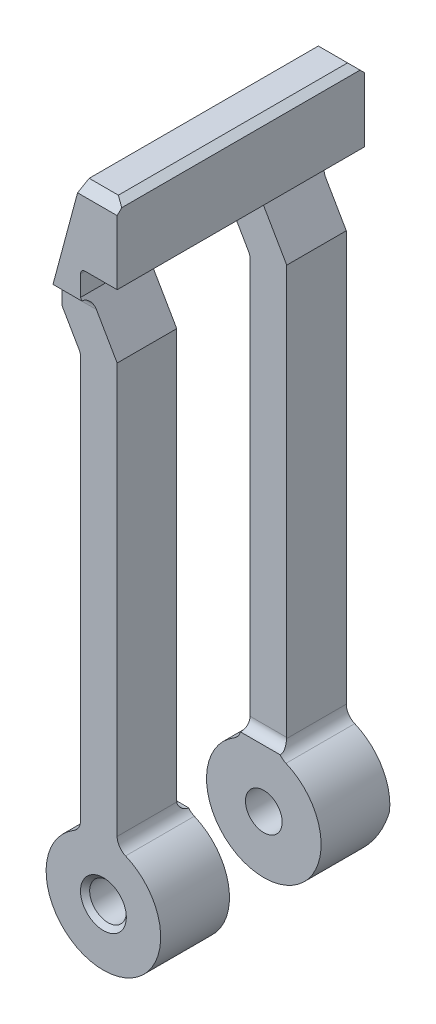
ISO-10303-21;
HEADER;
FILE_DESCRIPTION(('STEP AP214'),'2;1');
FILE_NAME('part.step','',(''),(''),'','','');
FILE_SCHEMA(('AUTOMOTIVE_DESIGN { 1 0 10303 214 1 1 1 1 }'));
ENDSEC;
DATA;
#1=APPLICATION_CONTEXT('core data for automotive mechanical design processes');
#2=APPLICATION_PROTOCOL_DEFINITION('international standard','automotive_design',2000,#1);
#3=PRODUCT_CONTEXT('',#1,'mechanical');
#4=PRODUCT('Part','Part','',(#3));
#5=PRODUCT_RELATED_PRODUCT_CATEGORY('part','',(#4));
#6=PRODUCT_DEFINITION_FORMATION('','',#4);
#7=PRODUCT_DEFINITION_CONTEXT('part definition',#1,'design');
#8=PRODUCT_DEFINITION('design','',#6,#7);
#9=PRODUCT_DEFINITION_SHAPE('','',#8);
#10=(LENGTH_UNIT() NAMED_UNIT(*) SI_UNIT(.MILLI.,.METRE.));
#11=(NAMED_UNIT(*) PLANE_ANGLE_UNIT() SI_UNIT($,.RADIAN.));
#12=(NAMED_UNIT(*) SI_UNIT($,.STERADIAN.) SOLID_ANGLE_UNIT());
#13=UNCERTAINTY_MEASURE_WITH_UNIT(LENGTH_MEASURE(1.E-05),#10,'distance_accuracy_value','');
#14=(GEOMETRIC_REPRESENTATION_CONTEXT(3) GLOBAL_UNCERTAINTY_ASSIGNED_CONTEXT((#13)) GLOBAL_UNIT_ASSIGNED_CONTEXT((#10,
#11,#12)) REPRESENTATION_CONTEXT('',''));
#15=CARTESIAN_POINT('',(0.,0.,0.));
#16=DIRECTION('',(0.,0.,1.));
#17=DIRECTION('',(1.,0.,0.));
#18=AXIS2_PLACEMENT_3D('',#15,#16,#17);
#19=CARTESIAN_POINT('',(-7.99999999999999,13.2759180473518,54.));
#20=DIRECTION('',(0.,0.,-1.));
#21=DIRECTION('',(-1.,0.,0.));
#22=AXIS2_PLACEMENT_3D('',#19,#20,#21);
#23=CYLINDRICAL_SURFACE('',#22,3.);
#24=DIRECTION('',(0.,0.,-1.));
#25=VECTOR('',#24,1.);
#26=CARTESIAN_POINT('',(-4.99999999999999,13.2759180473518,54.));
#27=LINE('',#26,#25);
#28=CARTESIAN_POINT('',(-4.99999999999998,13.2759180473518,15.4183478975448));
#29=VERTEX_POINT('',#28);
#30=CARTESIAN_POINT('',(-4.99999999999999,13.2759180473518,2.));
#31=VERTEX_POINT('',#30);
#32=EDGE_CURVE('E487',#29,#31,#27,.T.);
#33=ORIENTED_EDGE('',*,*,#32,.T.);
#34=CARTESIAN_POINT('',(-7.99999999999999,13.2759180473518,2.));
#35=DIRECTION('',(0.,0.,1.));
#36=DIRECTION('',(1.,0.,0.));
#37=AXIS2_PLACEMENT_3D('',#34,#35,#36);
#38=CIRCLE('',#37,3.);
#39=CARTESIAN_POINT('',(-6.4516129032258,10.7063855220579,2.));
#40=VERTEX_POINT('',#39);
#41=EDGE_CURVE('E334',#31,#40,#38,.F.);
#42=ORIENTED_EDGE('',*,*,#41,.T.);
#43=DIRECTION('',(0.,0.,-1.));
#44=VECTOR('',#43,1.);
#45=CARTESIAN_POINT('',(-6.45161290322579,10.7063855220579,54.));
#46=LINE('',#45,#44);
#47=CARTESIAN_POINT('',(-6.4516129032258,10.7063855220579,17.));
#48=VERTEX_POINT('',#47);
#49=EDGE_CURVE('E530',#48,#40,#46,.T.);
#50=ORIENTED_EDGE('',*,*,#49,.F.);
#51=CARTESIAN_POINT('',(-7.99999999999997,13.2759180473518,17.));
#52=DIRECTION('',(0.,0.,-1.));
#53=DIRECTION('',(-1.,0.,0.));
#54=AXIS2_PLACEMENT_3D('',#51,#52,#53);
#55=CIRCLE('',#54,3.);
#56=CARTESIAN_POINT('',(-5.10207812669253,12.5,17.));
#57=VERTEX_POINT('',#56);
#58=EDGE_CURVE('E317',#48,#57,#55,.F.);
#59=ORIENTED_EDGE('',*,*,#58,.T.);
#60=CARTESIAN_POINT('',(-4.99999999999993,13.2759180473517,18.5816521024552));
#61=CARTESIAN_POINT('',(-4.9999987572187,13.2318995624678,18.5475869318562));
#62=CARTESIAN_POINT('',(-5.00096885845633,13.1893363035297,18.5117047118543));
#63=CARTESIAN_POINT('',(-5.00445672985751,13.1073966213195,18.4365739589));
#64=CARTESIAN_POINT('',(-5.00697374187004,13.0680186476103,18.3973270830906));
#65=CARTESIAN_POINT('',(-5.01624230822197,12.955167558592,18.2750541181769));
#66=CARTESIAN_POINT('',(-5.02471460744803,12.8867960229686,18.1873549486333));
#67=CARTESIAN_POINT('',(-5.04307769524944,12.7656448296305,18.0021307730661));
#68=CARTESIAN_POINT('',(-5.0529669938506,12.7128489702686,17.9046161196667));
#69=CARTESIAN_POINT('',(-5.07133260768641,12.6240201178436,17.7020798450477));
#70=CARTESIAN_POINT('',(-5.07980896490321,12.5879866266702,17.5970584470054));
#71=CARTESIAN_POINT('',(-5.09323076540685,12.5332779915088,17.3803950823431));
#72=CARTESIAN_POINT('',(-5.09811238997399,12.5149148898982,17.268669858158));
#73=CARTESIAN_POINT('',(-5.10278844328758,12.4972949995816,17.0436281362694));
#74=CARTESIAN_POINT('',(-5.10258402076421,12.4980338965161,16.9303120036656));
#75=CARTESIAN_POINT('',(-5.09724018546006,12.5182366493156,16.7092538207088));
#76=CARTESIAN_POINT('',(-5.09226263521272,12.5370863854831,16.6014507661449));
#77=CARTESIAN_POINT('',(-5.0788583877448,12.5920164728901,16.390503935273));
#78=CARTESIAN_POINT('',(-5.07042973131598,12.6281066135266,16.2873628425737));
#79=CARTESIAN_POINT('',(-5.05213045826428,12.7172048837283,16.0868280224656));
#80=CARTESIAN_POINT('',(-5.04223886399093,12.7704753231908,15.9895531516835));
#81=CARTESIAN_POINT('',(-5.02398314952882,12.8923844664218,15.8051134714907));
#82=CARTESIAN_POINT('',(-5.01561680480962,12.9610004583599,15.717934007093));
#83=CARTESIAN_POINT('',(-5.00662565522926,13.0732396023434,15.5973983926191));
#84=CARTESIAN_POINT('',(-5.00422935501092,13.1117280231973,15.5592943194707));
#85=CARTESIAN_POINT('',(-5.00091671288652,13.1916601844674,15.486338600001));
#86=CARTESIAN_POINT('',(-4.99999891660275,13.2331009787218,15.451483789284));
#87=CARTESIAN_POINT('',(-4.99999999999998,13.2759180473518,15.4183478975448));
#88=B_SPLINE_CURVE_WITH_KNOTS('',3,(#60,#61,#62,#63,#64,#65,#66,#67,#68,#69,#70,#71,#72,#73,#74,
#75,#76,#77,#78,#79,#80,#81,#82,#83,#84,#85,#86,#87),.UNSPECIFIED.,.F.,.F.,(4,2,2,2,2,2,2,2,2,2,
2,2,2,4),(0.,0.166854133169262,0.333626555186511,0.666492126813,0.999010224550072,
1.33151844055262,1.6697961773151,2.00799751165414,2.33512122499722,2.66243090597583,
2.99499542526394,3.32707095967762,3.48953689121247,3.6518429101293),.UNSPECIFIED.);
#89=EDGE_CURVE('E429',#57,#29,#88,.T.);
#90=ORIENTED_EDGE('',*,*,#89,.T.);
#91=EDGE_LOOP('',(#33,#42,#50,#59,#90));
#92=FACE_BOUND('',#91,.T.);
#93=ADVANCED_FACE('F31',(#92),#23,.F.);
#94=CARTESIAN_POINT('',(0.,0.,54.));
#95=DIRECTION('',(0.,0.,-1.));
#96=DIRECTION('',(-1.,0.,0.));
#97=AXIS2_PLACEMENT_3D('',#94,#95,#96);
#98=CYLINDRICAL_SURFACE('',#97,12.5);
#99=CARTESIAN_POINT('',(0.,0.,1.65063509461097));
#100=DIRECTION('',(0.,0.258819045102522,0.965925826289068));
#101=DIRECTION('',(0.,0.965925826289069,-0.258819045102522));
#102=AXIS2_PLACEMENT_3D('',#99,#100,#101);
#103=ELLIPSE('',#102,12.940952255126,12.5);
#104=CARTESIAN_POINT('',(-12.4318132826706,-1.30384757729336,2.));
#105=VERTEX_POINT('',#104);
#106=CARTESIAN_POINT('',(12.4318132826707,-1.30384757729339,1.99999999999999));
#107=VERTEX_POINT('',#106);
#108=EDGE_CURVE('E320',#105,#107,#103,.T.);
#109=ORIENTED_EDGE('',*,*,#108,.T.);
#110=CARTESIAN_POINT('',(0.,0.,2.));
#111=DIRECTION('',(0.,0.,1.));
#112=DIRECTION('',(1.,0.,0.));
#113=AXIS2_PLACEMENT_3D('',#110,#111,#112);
#114=CIRCLE('',#113,12.5);
#115=CARTESIAN_POINT('',(4.83870967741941,11.5254886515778,2.));
#116=VERTEX_POINT('',#115);
#117=EDGE_CURVE('E341',#107,#116,#114,.T.);
#118=ORIENTED_EDGE('',*,*,#117,.T.);
#119=DIRECTION('',(0.,0.,-1.));
#120=VECTOR('',#119,1.);
#121=CARTESIAN_POINT('',(4.83870967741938,11.5254886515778,54.));
#122=LINE('',#121,#120);
#123=CARTESIAN_POINT('',(4.8387096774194,11.5254886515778,17.));
#124=VERTEX_POINT('',#123);
#125=EDGE_CURVE('E527',#124,#116,#122,.T.);
#126=ORIENTED_EDGE('',*,*,#125,.F.);
#127=CARTESIAN_POINT('',(0.,0.,17.));
#128=DIRECTION('',(0.,0.,-1.));
#129=DIRECTION('',(-1.,0.,0.));
#130=AXIS2_PLACEMENT_3D('',#127,#128,#129);
#131=CIRCLE('',#130,12.5);
#132=EDGE_CURVE('E314',#124,#48,#131,.T.);
#133=ORIENTED_EDGE('',*,*,#132,.T.);
#134=ORIENTED_EDGE('',*,*,#49,.T.);
#135=EDGE_CURVE('E337',#40,#105,#114,.T.);
#136=ORIENTED_EDGE('',*,*,#135,.T.);
#137=EDGE_LOOP('',(#109,#118,#126,#133,#134,#136));
#138=FACE_BOUND('',#137,.T.);
#139=ADVANCED_FACE('F697',(#138),#98,.T.);
#140=CARTESIAN_POINT('',(6.00000000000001,14.2916059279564,53.9999999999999));
#141=DIRECTION('',(0.,0.,-1.));
#142=DIRECTION('',(-1.,0.,0.));
#143=AXIS2_PLACEMENT_3D('',#140,#141,#142);
#144=CYLINDRICAL_SURFACE('',#143,3.);
#145=ORIENTED_EDGE('',*,*,#125,.T.);
#146=CARTESIAN_POINT('',(6.00000000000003,14.2916059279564,2.));
#147=DIRECTION('',(0.,0.,1.));
#148=DIRECTION('',(1.,0.,0.));
#149=AXIS2_PLACEMENT_3D('',#146,#147,#148);
#150=CIRCLE('',#149,3.);
#151=CARTESIAN_POINT('',(3.00000000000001,14.2916059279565,2.));
#152=VERTEX_POINT('',#151);
#153=EDGE_CURVE('E347',#116,#152,#150,.F.);
#154=ORIENTED_EDGE('',*,*,#153,.T.);
#155=DIRECTION('',(0.,0.,-1.));
#156=VECTOR('',#155,1.);
#157=CARTESIAN_POINT('',(3.00000000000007,14.2916059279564,54.));
#158=LINE('',#157,#156);
#159=CARTESIAN_POINT('',(3.00000000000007,14.2916059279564,15.0108866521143));
#160=VERTEX_POINT('',#159);
#161=EDGE_CURVE('E523',#160,#152,#158,.T.);
#162=ORIENTED_EDGE('',*,*,#161,.F.);
#163=CARTESIAN_POINT('',(3.00000000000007,14.2916059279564,15.0108866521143));
#164=CARTESIAN_POINT('',(2.99998931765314,14.2405108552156,15.0162298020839));
#165=CARTESIAN_POINT('',(3.00130500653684,14.1896349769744,15.0235597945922));
#166=CARTESIAN_POINT('',(3.00644319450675,14.0887516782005,15.0420693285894));
#167=CARTESIAN_POINT('',(3.01026396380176,14.038743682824,15.0532462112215));
#168=CARTESIAN_POINT('',(3.02023567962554,13.9402616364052,15.0792520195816));
#169=CARTESIAN_POINT('',(3.02637199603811,13.8917799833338,15.0940578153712));
#170=CARTESIAN_POINT('',(3.04076578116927,13.7963643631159,15.1271811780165));
#171=CARTESIAN_POINT('',(3.04902353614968,13.7494306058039,15.1454992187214));
#172=CARTESIAN_POINT('',(3.07658433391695,13.6116239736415,15.2053464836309));
#173=CARTESIAN_POINT('',(3.09871078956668,13.5234170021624,15.2518569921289));
#174=CARTESIAN_POINT('',(3.1483184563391,13.3558794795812,15.3565922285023));
#175=CARTESIAN_POINT('',(3.17580760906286,13.2765623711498,15.4148343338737));
#176=CARTESIAN_POINT('',(3.23640985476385,13.1210745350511,15.5474386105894));
#177=CARTESIAN_POINT('',(3.26980741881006,13.0458565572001,15.6227883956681));
#178=CARTESIAN_POINT('',(3.33688324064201,12.9082462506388,15.7844311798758));
#179=CARTESIAN_POINT('',(3.37056178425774,12.845869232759,15.8707370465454));
#180=CARTESIAN_POINT('',(3.43801543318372,12.7291579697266,16.0629393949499));
#181=CARTESIAN_POINT('',(3.47141238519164,12.6764071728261,16.1699443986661));
#182=CARTESIAN_POINT('',(3.52848831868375,12.5903296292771,16.3938291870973));
#183=CARTESIAN_POINT('',(3.55219209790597,12.5569532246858,16.5106828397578));
#184=CARTESIAN_POINT('',(3.58061565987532,12.5176271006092,16.7198764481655));
#185=CARTESIAN_POINT('',(3.58863530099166,12.5068534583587,16.8108675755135));
#186=CARTESIAN_POINT('',(3.5952694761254,12.497919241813,16.9937895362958));
#187=CARTESIAN_POINT('',(3.59389009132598,12.4997505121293,17.0857197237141));
#188=CARTESIAN_POINT('',(3.58195756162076,12.5158915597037,17.267680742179));
#189=CARTESIAN_POINT('',(3.571419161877,12.5301812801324,17.3577143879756));
#190=CARTESIAN_POINT('',(3.54271988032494,12.5704506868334,17.533873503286));
#191=CARTESIAN_POINT('',(3.52455248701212,12.5964403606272,17.6199955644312));
#192=CARTESIAN_POINT('',(3.48140975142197,12.6611750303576,17.7923048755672));
#193=CARTESIAN_POINT('',(3.45606491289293,12.7006472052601,17.8781230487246));
#194=CARTESIAN_POINT('',(3.40194319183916,12.7906527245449,18.0425601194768));
#195=CARTESIAN_POINT('',(3.37316440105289,12.8411922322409,18.1211749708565));
#196=CARTESIAN_POINT('',(3.30902062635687,12.9633528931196,18.2849407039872));
#197=CARTESIAN_POINT('',(3.27346196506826,13.0371620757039,18.3683959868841));
#198=CARTESIAN_POINT('',(3.20494473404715,13.1982832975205,18.5224927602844));
#199=CARTESIAN_POINT('',(3.17198849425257,13.2856072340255,18.5931228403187));
#200=CARTESIAN_POINT('',(3.11099831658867,13.4766779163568,18.7223940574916));
#201=CARTESIAN_POINT('',(3.0832471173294,13.5809808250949,18.7803654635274));
#202=CARTESIAN_POINT('',(3.04966775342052,13.745093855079,18.8530260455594));
#203=CARTESIAN_POINT('',(3.03982062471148,13.801025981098,18.8748515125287));
#204=CARTESIAN_POINT('',(3.02317445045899,13.9150223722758,18.9134816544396));
#205=CARTESIAN_POINT('',(3.01637306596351,13.973084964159,18.9302901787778));
#206=CARTESIAN_POINT('',(3.00755539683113,14.0745599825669,18.9547189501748));
#207=CARTESIAN_POINT('',(3.00473733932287,14.1176064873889,18.9635948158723));
#208=CARTESIAN_POINT('',(3.00095760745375,14.2042494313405,18.9785011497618));
#209=CARTESIAN_POINT('',(2.99999510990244,14.2478456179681,18.9845328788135));
#210=CARTESIAN_POINT('',(2.9999999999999,14.2916059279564,18.9891133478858));
#211=B_SPLINE_CURVE_WITH_KNOTS('',3,(#163,#164,#165,#166,#167,#168,#169,#170,#171,#172,#173,
#174,#175,#176,#177,#178,#179,#180,#181,#182,#183,#184,#185,#186,#187,#188,#189,#190,#191,#192,
#193,#194,#195,#196,#197,#198,#199,#200,#201,#202,#203,#204,#205,#206,#207,#208,#209,#210),
.UNSPECIFIED.,.F.,.F.,(4,2,2,2,2,2,2,2,2,2,2,2,2,2,2,2,2,2,2,2,2,2,2,4),(0.,0.154048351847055,
0.307990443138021,0.46097575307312,0.613981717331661,0.918979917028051,1.22443326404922,
1.55784930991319,1.89166062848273,2.26132562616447,2.63003891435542,2.90471547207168,
3.1792143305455,3.45327208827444,3.72756423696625,4.01991670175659,4.31243239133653,
4.66175516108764,5.01138721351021,5.3765081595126,5.55877198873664,5.74089560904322,
5.87289592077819,6.00483765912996),.UNSPECIFIED.);
#212=CARTESIAN_POINT('',(3.59372732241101,12.5,17.));
#213=VERTEX_POINT('',#212);
#214=EDGE_CURVE('E406',#160,#213,#211,.T.);
#215=ORIENTED_EDGE('',*,*,#214,.T.);
#216=CARTESIAN_POINT('',(6.00000000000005,14.2916059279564,17.));
#217=DIRECTION('',(0.,0.,-1.));
#218=DIRECTION('',(-1.,0.,0.));
#219=AXIS2_PLACEMENT_3D('',#216,#217,#218);
#220=CIRCLE('',#219,3.);
#221=EDGE_CURVE('E311',#213,#124,#220,.F.);
#222=ORIENTED_EDGE('',*,*,#221,.T.);
#223=EDGE_LOOP('',(#145,#154,#162,#215,#222));
#224=FACE_BOUND('',#223,.T.);
#225=ADVANCED_FACE('F402',(#224),#144,.F.);
#226=CARTESIAN_POINT('',(3.00000000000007,14.2916059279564,54.));
#227=DIRECTION('',(-1.,0.,0.));
#228=DIRECTION('',(0.,-1.,0.));
#229=AXIS2_PLACEMENT_3D('',#226,#227,#228);
#230=PLANE('',#229);
#231=ORIENTED_EDGE('',*,*,#161,.T.);
#232=DIRECTION('',(0.,1.,0.));
#233=VECTOR('',#232,1.);
#234=CARTESIAN_POINT('',(3.00000000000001,14.2916059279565,2.));
#235=LINE('',#234,#233);
#236=CARTESIAN_POINT('',(3.00000000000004,103.743593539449,1.99999999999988));
#237=VERTEX_POINT('',#236);
#238=EDGE_CURVE('E344',#152,#237,#235,.T.);
#239=ORIENTED_EDGE('',*,*,#238,.T.);
#240=DIRECTION('',(0.,0.,-1.));
#241=VECTOR('',#240,1.);
#242=CARTESIAN_POINT('',(3.00000000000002,103.743593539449,54.));
#243=LINE('',#242,#241);
#244=CARTESIAN_POINT('',(3.00000000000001,103.743593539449,15.));
#245=VERTEX_POINT('',#244);
#246=EDGE_CURVE('E519',#245,#237,#243,.T.);
#247=ORIENTED_EDGE('',*,*,#246,.F.);
#248=DIRECTION('',(0.,-1.,0.));
#249=VECTOR('',#248,1.);
#250=CARTESIAN_POINT('',(3.00000000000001,14.2916059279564,15.));
#251=LINE('',#250,#249);
#252=CARTESIAN_POINT('',(3.00000000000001,14.5,15.));
#253=VERTEX_POINT('',#252);
#254=EDGE_CURVE('E436',#245,#253,#251,.T.);
#255=ORIENTED_EDGE('',*,*,#254,.T.);
#256=CARTESIAN_POINT('',(3.00000000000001,14.5,17.));
#257=DIRECTION('',(-1.,0.,0.));
#258=DIRECTION('',(0.,-1.,0.));
#259=AXIS2_PLACEMENT_3D('',#256,#257,#258);
#260=CIRCLE('',#259,2.);
#261=EDGE_CURVE('E416',#253,#160,#260,.T.);
#262=ORIENTED_EDGE('',*,*,#261,.T.);
#263=EDGE_LOOP('',(#231,#239,#247,#255,#262));
#264=FACE_BOUND('',#263,.T.);
#265=ADVANCED_FACE('F686',(#264),#230,.F.);
#266=CARTESIAN_POINT('',(-9.,113.6,54.));
#267=DIRECTION('',(1.,0.,0.));
#268=DIRECTION('',(0.,1.,0.));
#269=AXIS2_PLACEMENT_3D('',#266,#267,#268);
#270=PLANE('',#269);
#271=DIRECTION('',(0.,0.,-1.));
#272=VECTOR('',#271,1.);
#273=CARTESIAN_POINT('',(-9.,113.6,54.));
#274=LINE('',#273,#272);
#275=CARTESIAN_POINT('',(-9.,113.6,15.));
#276=VERTEX_POINT('',#275);
#277=CARTESIAN_POINT('',(-9.00000000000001,113.6,0.));
#278=VERTEX_POINT('',#277);
#279=EDGE_CURVE('E499',#276,#278,#274,.T.);
#280=ORIENTED_EDGE('',*,*,#279,.T.);
#281=CARTESIAN_POINT('',(-8.99999999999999,111.6,0.));
#282=DIRECTION('',(1.,0.,0.));
#283=DIRECTION('',(0.,1.,0.));
#284=AXIS2_PLACEMENT_3D('',#281,#282,#283);
#285=CIRCLE('',#284,2.);
#286=CARTESIAN_POINT('',(-8.99999999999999,111.6,2.));
#287=VERTEX_POINT('',#286);
#288=EDGE_CURVE('E550',#278,#287,#285,.T.);
#289=ORIENTED_EDGE('',*,*,#288,.T.);
#290=DIRECTION('',(0.,-1.,0.));
#291=VECTOR('',#290,1.);
#292=CARTESIAN_POINT('',(-8.99999999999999,113.6,2.));
#293=LINE('',#292,#291);
#294=CARTESIAN_POINT('',(-8.99999999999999,108.528203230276,2.));
#295=VERTEX_POINT('',#294);
#296=EDGE_CURVE('E331',#287,#295,#293,.T.);
#297=ORIENTED_EDGE('',*,*,#296,.T.);
#298=DIRECTION('',(0.,0.,-1.));
#299=VECTOR('',#298,1.);
#300=CARTESIAN_POINT('',(-8.99999999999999,108.528203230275,54.));
#301=LINE('',#300,#299);
#302=CARTESIAN_POINT('',(-8.99999999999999,108.528203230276,15.));
#303=VERTEX_POINT('',#302);
#304=EDGE_CURVE('E490',#303,#295,#301,.T.);
#305=ORIENTED_EDGE('',*,*,#304,.F.);
#306=DIRECTION('',(0.,1.,0.));
#307=VECTOR('',#306,1.);
#308=CARTESIAN_POINT('',(-9.,113.6,15.));
#309=LINE('',#308,#307);
#310=EDGE_CURVE('E442',#303,#276,#309,.T.);
#311=ORIENTED_EDGE('',*,*,#310,.T.);
#312=EDGE_LOOP('',(#280,#289,#297,#305,#311));
#313=FACE_BOUND('',#312,.T.);
#314=ADVANCED_FACE('F672',(#313),#270,.F.);
#315=CARTESIAN_POINT('',(-8.99999999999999,108.528203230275,54.));
#316=DIRECTION('',(0.866025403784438,0.500000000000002,0.));
#317=DIRECTION('',(-0.500000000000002,0.866025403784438,0.));
#318=AXIS2_PLACEMENT_3D('',#315,#316,#317);
#319=PLANE('',#318);
#320=ORIENTED_EDGE('',*,*,#304,.T.);
#321=DIRECTION('',(0.500000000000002,-0.866025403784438,0.));
#322=VECTOR('',#321,1.);
#323=CARTESIAN_POINT('',(-8.99999999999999,108.528203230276,2.));
#324=LINE('',#323,#322);
#325=CARTESIAN_POINT('',(-5.26794919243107,102.064101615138,2.));
#326=VERTEX_POINT('',#325);
#327=EDGE_CURVE('E328',#295,#326,#324,.T.);
#328=ORIENTED_EDGE('',*,*,#327,.T.);
#329=DIRECTION('',(0.,0.,-1.));
#330=VECTOR('',#329,1.);
#331=CARTESIAN_POINT('',(-5.2679491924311,102.064101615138,53.9999999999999));
#332=LINE('',#331,#330);
#333=CARTESIAN_POINT('',(-5.26794919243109,102.064101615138,15.));
#334=VERTEX_POINT('',#333);
#335=EDGE_CURVE('E479',#334,#326,#332,.T.);
#336=ORIENTED_EDGE('',*,*,#335,.F.);
#337=DIRECTION('',(-0.500000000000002,0.866025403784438,0.));
#338=VECTOR('',#337,1.);
#339=CARTESIAN_POINT('',(-8.99999999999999,108.528203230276,15.));
#340=LINE('',#339,#338);
#341=EDGE_CURVE('E445',#334,#303,#340,.T.);
#342=ORIENTED_EDGE('',*,*,#341,.T.);
#343=EDGE_LOOP('',(#320,#328,#336,#342));
#344=FACE_BOUND('',#343,.T.);
#345=ADVANCED_FACE('F674',(#344),#319,.F.);
#346=CARTESIAN_POINT('',(-7.,101.064101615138,53.9999999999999));
#347=DIRECTION('',(0.,0.,-1.));
#348=DIRECTION('',(-1.,0.,0.));
#349=AXIS2_PLACEMENT_3D('',#346,#347,#348);
#350=CYLINDRICAL_SURFACE('',#349,2.);
#351=ORIENTED_EDGE('',*,*,#335,.T.);
#352=CARTESIAN_POINT('',(-6.99999999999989,101.064101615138,2.));
#353=DIRECTION('',(0.,0.,1.));
#354=DIRECTION('',(1.,0.,0.));
#355=AXIS2_PLACEMENT_3D('',#352,#353,#354);
#356=CIRCLE('',#355,2.);
#357=CARTESIAN_POINT('',(-4.99999999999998,101.064101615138,2.));
#358=VERTEX_POINT('',#357);
#359=EDGE_CURVE('E325',#326,#358,#356,.F.);
#360=ORIENTED_EDGE('',*,*,#359,.T.);
#361=DIRECTION('',(0.,0.,-1.));
#362=VECTOR('',#361,1.);
#363=CARTESIAN_POINT('',(-4.99999999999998,101.064101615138,54.));
#364=LINE('',#363,#362);
#365=CARTESIAN_POINT('',(-5.,101.064101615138,14.9999999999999));
#366=VERTEX_POINT('',#365);
#367=EDGE_CURVE('E480',#366,#358,#364,.T.);
#368=ORIENTED_EDGE('',*,*,#367,.F.);
#369=CARTESIAN_POINT('',(-6.99999999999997,101.064101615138,15.));
#370=DIRECTION('',(0.,0.,-1.));
#371=DIRECTION('',(0.,1.,0.));
#372=AXIS2_PLACEMENT_3D('',#369,#370,#371);
#373=CIRCLE('',#372,2.);
#374=EDGE_CURVE('E448',#366,#334,#373,.F.);
#375=ORIENTED_EDGE('',*,*,#374,.T.);
#376=EDGE_LOOP('',(#351,#360,#368,#375));
#377=FACE_BOUND('',#376,.T.);
#378=ADVANCED_FACE('F678',(#377),#350,.F.);
#379=CARTESIAN_POINT('',(-4.99999999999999,13.2759180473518,54.));
#380=DIRECTION('',(1.,0.,0.));
#381=DIRECTION('',(0.,1.,0.));
#382=AXIS2_PLACEMENT_3D('',#379,#380,#381);
#383=PLANE('',#382);
#384=ORIENTED_EDGE('',*,*,#367,.T.);
#385=DIRECTION('',(0.,-1.,0.));
#386=VECTOR('',#385,1.);
#387=CARTESIAN_POINT('',(-4.99999999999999,13.2759180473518,2.));
#388=LINE('',#387,#386);
#389=EDGE_CURVE('E322',#358,#31,#388,.T.);
#390=ORIENTED_EDGE('',*,*,#389,.T.);
#391=ORIENTED_EDGE('',*,*,#32,.F.);
#392=CARTESIAN_POINT('',(-4.99999999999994,14.5,17.));
#393=DIRECTION('',(1.,0.,0.));
#394=DIRECTION('',(0.,1.,0.));
#395=AXIS2_PLACEMENT_3D('',#392,#393,#394);
#396=CIRCLE('',#395,2.);
#397=CARTESIAN_POINT('',(-4.99999999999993,14.5,15.));
#398=VERTEX_POINT('',#397);
#399=EDGE_CURVE('E547',#29,#398,#396,.T.);
#400=ORIENTED_EDGE('',*,*,#399,.T.);
#401=DIRECTION('',(0.,1.,0.));
#402=VECTOR('',#401,1.);
#403=CARTESIAN_POINT('',(-4.99999999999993,13.2759180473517,15.));
#404=LINE('',#403,#402);
#405=EDGE_CURVE('E544',#398,#366,#404,.T.);
#406=ORIENTED_EDGE('',*,*,#405,.T.);
#407=EDGE_LOOP('',(#384,#390,#391,#400,#406));
#408=FACE_BOUND('',#407,.T.);
#409=ADVANCED_FACE('F680',(#408),#383,.F.);
#410=CARTESIAN_POINT('',(-7.99999999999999,13.2759180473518,54.));
#411=DIRECTION('',(0.,0.,1.));
#412=DIRECTION('',(1.,0.,0.));
#413=AXIS2_PLACEMENT_3D('',#410,#411,#412);
#414=PLANE('',#413);
#415=DIRECTION('',(0.,1.,0.));
#416=VECTOR('',#415,1.);
#417=CARTESIAN_POINT('',(5.00000000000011,119.6,54.));
#418=LINE('',#417,#416);
#419=CARTESIAN_POINT('',(5.00000000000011,119.6,54.));
#420=VERTEX_POINT('',#419);
#421=CARTESIAN_POINT('',(5.00000000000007,133.6,54.));
#422=VERTEX_POINT('',#421);
#423=EDGE_CURVE('E616',#420,#422,#418,.T.);
#424=ORIENTED_EDGE('',*,*,#423,.T.);
#425=DIRECTION('',(-1.,0.,0.));
#426=VECTOR('',#425,1.);
#427=CARTESIAN_POINT('',(-3.1051177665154,133.6,54.));
#428=LINE('',#427,#426);
#429=CARTESIAN_POINT('',(-3.64101615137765,133.6,54.));
#430=VERTEX_POINT('',#429);
#431=EDGE_CURVE('E11',#422,#430,#428,.T.);
#432=ORIENTED_EDGE('',*,*,#431,.T.);
#433=DIRECTION('',(-0.258819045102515,-0.96592582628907,0.));
#434=VECTOR('',#433,1.);
#435=CARTESIAN_POINT('',(-3.10511776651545,135.6,53.9999999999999));
#436=LINE('',#435,#434);
#437=CARTESIAN_POINT('',(-9.,113.6,54.));
#438=VERTEX_POINT('',#437);
#439=EDGE_CURVE('E617',#430,#438,#436,.T.);
#440=ORIENTED_EDGE('',*,*,#439,.T.);
#441=DIRECTION('',(-1.,0.,0.));
#442=VECTOR('',#441,1.);
#443=CARTESIAN_POINT('',(20.,113.6,53.9999999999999));
#444=LINE('',#443,#442);
#445=CARTESIAN_POINT('',(-2.69059892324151,113.6,54.));
#446=VERTEX_POINT('',#445);
#447=EDGE_CURVE('E651',#446,#438,#444,.T.);
#448=ORIENTED_EDGE('',*,*,#447,.F.);
#449=DIRECTION('',(-0.500000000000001,0.866025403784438,0.));
#450=VECTOR('',#449,1.);
#451=CARTESIAN_POINT('',(3.00000000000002,103.743593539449,54.));
#452=LINE('',#451,#450);
#453=CARTESIAN_POINT('',(-2.99999999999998,114.135898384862,54.));
#454=VERTEX_POINT('',#453);
#455=EDGE_CURVE('E602',#446,#454,#452,.T.);
#456=ORIENTED_EDGE('',*,*,#455,.T.);
#457=DIRECTION('',(0.,1.,0.));
#458=VECTOR('',#457,1.);
#459=CARTESIAN_POINT('',(-2.99999999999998,114.135898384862,54.));
#460=LINE('',#459,#458);
#461=CARTESIAN_POINT('',(-3.,118.6,54.));
#462=VERTEX_POINT('',#461);
#463=EDGE_CURVE('E605',#454,#462,#460,.T.);
#464=ORIENTED_EDGE('',*,*,#463,.T.);
#465=CARTESIAN_POINT('',(-2.00000000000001,118.6,54.));
#466=DIRECTION('',(0.,0.,-1.));
#467=DIRECTION('',(-1.,0.,0.));
#468=AXIS2_PLACEMENT_3D('',#465,#466,#467);
#469=CIRCLE('',#468,1.);
#470=CARTESIAN_POINT('',(-1.99999999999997,119.6,54.));
#471=VERTEX_POINT('',#470);
#472=EDGE_CURVE('E612',#462,#471,#469,.T.);
#473=ORIENTED_EDGE('',*,*,#472,.T.);
#474=DIRECTION('',(1.,0.,0.));
#475=VECTOR('',#474,1.);
#476=CARTESIAN_POINT('',(-1.99999999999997,119.6,54.));
#477=LINE('',#476,#475);
#478=EDGE_CURVE('E614',#471,#420,#477,.T.);
#479=ORIENTED_EDGE('',*,*,#478,.T.);
#480=EDGE_LOOP('',(#424,#432,#440,#448,#456,#464,#473,#479));
#481=FACE_BOUND('',#480,.T.);
#482=ADVANCED_FACE('F735',(#481),#414,.T.);
#483=CARTESIAN_POINT('',(-7.99999999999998,13.2759180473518,0.));
#484=DIRECTION('',(0.,0.,1.));
#485=DIRECTION('',(1.,0.,0.));
#486=AXIS2_PLACEMENT_3D('',#483,#484,#485);
#487=PLANE('',#486);
#488=DIRECTION('',(-0.258819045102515,-0.96592582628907,0.));
#489=VECTOR('',#488,1.);
#490=CARTESIAN_POINT('',(-3.10511776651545,135.6,0.));
#491=LINE('',#490,#489);
#492=CARTESIAN_POINT('',(-3.64101615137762,133.6,0.));
#493=VERTEX_POINT('',#492);
#494=EDGE_CURVE('E593',#493,#278,#491,.T.);
#495=ORIENTED_EDGE('',*,*,#494,.F.);
#496=DIRECTION('',(1.,0.,0.));
#497=VECTOR('',#496,1.);
#498=CARTESIAN_POINT('',(-7.99999999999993,133.6,0.));
#499=LINE('',#498,#497);
#500=CARTESIAN_POINT('',(5.00000000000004,133.6,0.));
#501=VERTEX_POINT('',#500);
#502=EDGE_CURVE('E571',#493,#501,#499,.T.);
#503=ORIENTED_EDGE('',*,*,#502,.T.);
#504=DIRECTION('',(0.,1.,0.));
#505=VECTOR('',#504,1.);
#506=CARTESIAN_POINT('',(5.00000000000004,119.6,0.));
#507=LINE('',#506,#505);
#508=CARTESIAN_POINT('',(5.00000000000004,119.6,0.));
#509=VERTEX_POINT('',#508);
#510=EDGE_CURVE('E603',#509,#501,#507,.T.);
#511=ORIENTED_EDGE('',*,*,#510,.F.);
#512=DIRECTION('',(1.,0.,0.));
#513=VECTOR('',#512,1.);
#514=CARTESIAN_POINT('',(-1.99999999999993,119.6,0.));
#515=LINE('',#514,#513);
#516=CARTESIAN_POINT('',(-1.99999999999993,119.6,0.));
#517=VERTEX_POINT('',#516);
#518=EDGE_CURVE('E607',#517,#509,#515,.T.);
#519=ORIENTED_EDGE('',*,*,#518,.F.);
#520=CARTESIAN_POINT('',(-1.99999999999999,118.6,0.));
#521=DIRECTION('',(0.,0.,-1.));
#522=DIRECTION('',(-1.,0.,0.));
#523=AXIS2_PLACEMENT_3D('',#520,#521,#522);
#524=CIRCLE('',#523,1.);
#525=CARTESIAN_POINT('',(-2.99999999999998,118.6,0.));
#526=VERTEX_POINT('',#525);
#527=EDGE_CURVE('E725',#526,#517,#524,.T.);
#528=ORIENTED_EDGE('',*,*,#527,.F.);
#529=DIRECTION('',(0.,1.,0.));
#530=VECTOR('',#529,1.);
#531=CARTESIAN_POINT('',(-2.99999999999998,114.135898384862,0.));
#532=LINE('',#531,#530);
#533=CARTESIAN_POINT('',(-2.99999999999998,114.135898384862,0.));
#534=VERTEX_POINT('',#533);
#535=EDGE_CURVE('E723',#534,#526,#532,.T.);
#536=ORIENTED_EDGE('',*,*,#535,.F.);
#537=DIRECTION('',(-0.500000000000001,0.866025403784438,0.));
#538=VECTOR('',#537,1.);
#539=CARTESIAN_POINT('',(3.00000000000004,103.743593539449,-1.2490009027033E-13));
#540=LINE('',#539,#538);
#541=CARTESIAN_POINT('',(-2.69059892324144,113.6,0.));
#542=VERTEX_POINT('',#541);
#543=EDGE_CURVE('E719',#542,#534,#540,.T.);
#544=ORIENTED_EDGE('',*,*,#543,.F.);
#545=DIRECTION('',(-1.,0.,0.));
#546=VECTOR('',#545,1.);
#547=CARTESIAN_POINT('',(20.,113.6,0.));
#548=LINE('',#547,#546);
#549=EDGE_CURVE('E600',#542,#278,#548,.T.);
#550=ORIENTED_EDGE('',*,*,#549,.T.);
#551=EDGE_LOOP('',(#495,#503,#511,#519,#528,#536,#544,#550));
#552=FACE_BOUND('',#551,.T.);
#553=ADVANCED_FACE('F597',(#552),#487,.F.);
#554=CARTESIAN_POINT('',(-6.4516129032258,10.7063855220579,52.));
#555=VERTEX_POINT('',#554);
#556=CARTESIAN_POINT('',(-6.4516129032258,10.7063855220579,37.));
#557=VERTEX_POINT('',#556);
#558=EDGE_CURVE('E532',#555,#557,#46,.T.);
#559=ORIENTED_EDGE('',*,*,#558,.F.);
#560=CARTESIAN_POINT('',(-7.99999999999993,13.2759180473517,52.));
#561=DIRECTION('',(0.,0.,-1.));
#562=DIRECTION('',(0.,1.,0.));
#563=AXIS2_PLACEMENT_3D('',#560,#561,#562);
#564=CIRCLE('',#563,3.);
#565=CARTESIAN_POINT('',(-4.99999999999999,13.2759180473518,52.));
#566=VERTEX_POINT('',#565);
#567=EDGE_CURVE('E362',#555,#566,#564,.F.);
#568=ORIENTED_EDGE('',*,*,#567,.T.);
#569=CARTESIAN_POINT('',(-4.99999999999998,13.2759180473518,38.5816521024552));
#570=VERTEX_POINT('',#569);
#571=EDGE_CURVE('E485',#566,#570,#27,.T.);
#572=ORIENTED_EDGE('',*,*,#571,.T.);
#573=CARTESIAN_POINT('',(-4.99999999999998,13.2759180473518,38.5816521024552));
#574=CARTESIAN_POINT('',(-4.99999875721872,13.2318995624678,38.5475869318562));
#575=CARTESIAN_POINT('',(-5.00096885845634,13.1893363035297,38.5117047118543));
#576=CARTESIAN_POINT('',(-5.0044567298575,13.1073966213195,38.4365739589));
#577=CARTESIAN_POINT('',(-5.00697374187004,13.0680186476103,38.3973270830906));
#578=CARTESIAN_POINT('',(-5.01624230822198,12.955167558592,38.2750541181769));
#579=CARTESIAN_POINT('',(-5.02471460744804,12.8867960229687,38.1873549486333));
#580=CARTESIAN_POINT('',(-5.04307769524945,12.7656448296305,38.0021307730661));
#581=CARTESIAN_POINT('',(-5.05296699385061,12.7128489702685,37.9046161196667));
#582=CARTESIAN_POINT('',(-5.07133260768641,12.6240201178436,37.7020798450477));
#583=CARTESIAN_POINT('',(-5.0798089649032,12.5879866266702,37.5970584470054));
#584=CARTESIAN_POINT('',(-5.09323076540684,12.5332779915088,37.3803950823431));
#585=CARTESIAN_POINT('',(-5.098112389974,12.5149148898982,37.268669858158));
#586=CARTESIAN_POINT('',(-5.10278844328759,12.4972949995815,37.0436281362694));
#587=CARTESIAN_POINT('',(-5.10258402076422,12.4980338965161,36.9303120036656));
#588=CARTESIAN_POINT('',(-5.09724018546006,12.5182366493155,36.7092538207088));
#589=CARTESIAN_POINT('',(-5.09226263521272,12.5370863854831,36.6014507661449));
#590=CARTESIAN_POINT('',(-5.0788583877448,12.59201647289,36.390503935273));
#591=CARTESIAN_POINT('',(-5.07042973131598,12.6281066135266,36.2873628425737));
#592=CARTESIAN_POINT('',(-5.05213045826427,12.7172048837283,36.0868280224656));
#593=CARTESIAN_POINT('',(-5.04223886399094,12.7704753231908,35.9895531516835));
#594=CARTESIAN_POINT('',(-5.02398314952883,12.8923844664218,35.8051134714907));
#595=CARTESIAN_POINT('',(-5.01561680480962,12.9610004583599,35.717934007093));
#596=CARTESIAN_POINT('',(-5.00662565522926,13.0732396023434,35.5973983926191));
#597=CARTESIAN_POINT('',(-5.00422935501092,13.1117280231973,35.5592943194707));
#598=CARTESIAN_POINT('',(-5.00091671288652,13.1916601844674,35.486338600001));
#599=CARTESIAN_POINT('',(-4.99999891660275,13.2331009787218,35.451483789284));
#600=CARTESIAN_POINT('',(-4.99999999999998,13.2759180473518,35.4183478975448));
#601=B_SPLINE_CURVE_WITH_KNOTS('',3,(#573,#574,#575,#576,#577,#578,#579,#580,#581,#582,#583,
#584,#585,#586,#587,#588,#589,#590,#591,#592,#593,#594,#595,#596,#597,#598,#599,#600),
.UNSPECIFIED.,.F.,.F.,(4,2,2,2,2,2,2,2,2,2,2,2,2,4),(0.,0.166854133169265,0.333626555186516,
0.666492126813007,0.99901022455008,1.33151844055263,1.66979617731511,2.00799751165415,
2.33512122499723,2.66243090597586,2.99499542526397,3.32707095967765,3.48953689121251,
3.65184291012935),.UNSPECIFIED.);
#602=CARTESIAN_POINT('',(-5.10207812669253,12.5,37.));
#603=VERTEX_POINT('',#602);
#604=EDGE_CURVE('E375',#570,#603,#601,.T.);
#605=ORIENTED_EDGE('',*,*,#604,.T.);
#606=CARTESIAN_POINT('',(-7.99999999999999,13.2759180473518,37.));
#607=DIRECTION('',(0.,0.,1.));
#608=DIRECTION('',(0.,-1.,0.));
#609=AXIS2_PLACEMENT_3D('',#606,#607,#608);
#610=CIRCLE('',#609,3.);
#611=EDGE_CURVE('E293',#603,#557,#610,.F.);
#612=ORIENTED_EDGE('',*,*,#611,.T.);
#613=EDGE_LOOP('',(#559,#568,#572,#605,#612));
#614=FACE_BOUND('',#613,.T.);
#615=ADVANCED_FACE('F33',(#614),#23,.F.);
#616=CARTESIAN_POINT('',(0.,0.,52.));
#617=DIRECTION('',(0.,0.,-1.));
#618=DIRECTION('',(0.,1.,0.));
#619=AXIS2_PLACEMENT_3D('',#616,#617,#618);
#620=CIRCLE('',#619,12.5);
#621=CARTESIAN_POINT('',(4.83870967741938,11.5254886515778,52.));
#622=VERTEX_POINT('',#621);
#623=EDGE_CURVE('E365',#622,#555,#620,.T.);
#624=ORIENTED_EDGE('',*,*,#623,.T.);
#625=ORIENTED_EDGE('',*,*,#558,.T.);
#626=CARTESIAN_POINT('',(0.,0.,37.));
#627=DIRECTION('',(0.,0.,1.));
#628=DIRECTION('',(0.,-1.,0.));
#629=AXIS2_PLACEMENT_3D('',#626,#627,#628);
#630=CIRCLE('',#629,12.5);
#631=CARTESIAN_POINT('',(4.83870967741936,11.5254886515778,37.));
#632=VERTEX_POINT('',#631);
#633=EDGE_CURVE('E300',#557,#632,#630,.T.);
#634=ORIENTED_EDGE('',*,*,#633,.T.);
#635=EDGE_CURVE('E299',#622,#632,#122,.T.);
#636=ORIENTED_EDGE('',*,*,#635,.F.);
#637=EDGE_LOOP('',(#624,#625,#634,#636));
#638=FACE_BOUND('',#637,.T.);
#639=ADVANCED_FACE('F401',(#638),#98,.T.);
#640=CARTESIAN_POINT('',(3.00000000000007,14.2916059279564,52.));
#641=VERTEX_POINT('',#640);
#642=CARTESIAN_POINT('',(3.00000000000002,14.2916059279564,38.9891133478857));
#643=VERTEX_POINT('',#642);
#644=EDGE_CURVE('E526',#641,#643,#158,.T.);
#645=ORIENTED_EDGE('',*,*,#644,.F.);
#646=CARTESIAN_POINT('',(6.00000000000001,14.2916059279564,52.));
#647=DIRECTION('',(0.,0.,-1.));
#648=DIRECTION('',(0.,1.,0.));
#649=AXIS2_PLACEMENT_3D('',#646,#647,#648);
#650=CIRCLE('',#649,3.);
#651=EDGE_CURVE('E367',#641,#622,#650,.F.);
#652=ORIENTED_EDGE('',*,*,#651,.T.);
#653=ORIENTED_EDGE('',*,*,#635,.T.);
#654=CARTESIAN_POINT('',(6.00000000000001,14.2916059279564,37.));
#655=DIRECTION('',(0.,0.,1.));
#656=DIRECTION('',(0.,-1.,0.));
#657=AXIS2_PLACEMENT_3D('',#654,#655,#656);
#658=CIRCLE('',#657,3.);
#659=CARTESIAN_POINT('',(3.59372732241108,12.5,36.9999999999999));
#660=VERTEX_POINT('',#659);
#661=EDGE_CURVE('E290',#632,#660,#658,.F.);
#662=ORIENTED_EDGE('',*,*,#661,.T.);
#663=CARTESIAN_POINT('',(3.00000000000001,14.2916059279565,35.0108866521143));
#664=CARTESIAN_POINT('',(2.99998931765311,14.2405108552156,35.0162298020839));
#665=CARTESIAN_POINT('',(3.00130500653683,14.1896349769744,35.0235597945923));
#666=CARTESIAN_POINT('',(3.00644319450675,14.0887516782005,35.0420693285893));
#667=CARTESIAN_POINT('',(3.01026396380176,14.038743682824,35.0532462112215));
#668=CARTESIAN_POINT('',(3.02023567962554,13.9402616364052,35.0792520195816));
#669=CARTESIAN_POINT('',(3.02637199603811,13.8917799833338,35.0940578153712));
#670=CARTESIAN_POINT('',(3.04076578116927,13.7963643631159,35.1271811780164));
#671=CARTESIAN_POINT('',(3.04902353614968,13.7494306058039,35.1454992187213));
#672=CARTESIAN_POINT('',(3.07658433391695,13.6116239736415,35.2053464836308));
#673=CARTESIAN_POINT('',(3.09871078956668,13.5234170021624,35.2518569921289));
#674=CARTESIAN_POINT('',(3.14831845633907,13.3558794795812,35.3565922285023));
#675=CARTESIAN_POINT('',(3.1758076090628,13.2765623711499,35.4148343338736));
#676=CARTESIAN_POINT('',(3.2364098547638,13.1210745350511,35.5474386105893));
#677=CARTESIAN_POINT('',(3.26980741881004,13.0458565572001,35.6227883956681));
#678=CARTESIAN_POINT('',(3.33688324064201,12.9082462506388,35.7844311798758));
#679=CARTESIAN_POINT('',(3.37056178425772,12.845869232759,35.8707370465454));
#680=CARTESIAN_POINT('',(3.43801543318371,12.7291579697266,36.0629393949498));
#681=CARTESIAN_POINT('',(3.47141238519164,12.6764071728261,36.1699443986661));
#682=CARTESIAN_POINT('',(3.52848831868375,12.5903296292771,36.3938291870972));
#683=CARTESIAN_POINT('',(3.55219209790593,12.5569532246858,36.5106828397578));
#684=CARTESIAN_POINT('',(3.58061565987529,12.5176271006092,36.7198764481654));
#685=CARTESIAN_POINT('',(3.58863530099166,12.5068534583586,36.8108675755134));
#686=CARTESIAN_POINT('',(3.59526947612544,12.497919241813,36.9937895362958));
#687=CARTESIAN_POINT('',(3.59389009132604,12.4997505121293,37.0857197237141));
#688=CARTESIAN_POINT('',(3.58195756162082,12.5158915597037,37.2676807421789));
#689=CARTESIAN_POINT('',(3.57141916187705,12.5301812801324,37.3577143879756));
#690=CARTESIAN_POINT('',(3.54271988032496,12.5704506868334,37.533873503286));
#691=CARTESIAN_POINT('',(3.52455248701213,12.5964403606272,37.6199955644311));
#692=CARTESIAN_POINT('',(3.48140975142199,12.6611750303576,37.7923048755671));
#693=CARTESIAN_POINT('',(3.45606491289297,12.70064720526,37.8781230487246));
#694=CARTESIAN_POINT('',(3.40194319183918,12.7906527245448,38.0425601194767));
#695=CARTESIAN_POINT('',(3.37316440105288,12.8411922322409,38.1211749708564));
#696=CARTESIAN_POINT('',(3.30902062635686,12.9633528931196,38.2849407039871));
#697=CARTESIAN_POINT('',(3.27346196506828,13.0371620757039,38.3683959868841));
#698=CARTESIAN_POINT('',(3.20494473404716,13.1982832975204,38.5224927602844));
#699=CARTESIAN_POINT('',(3.17198849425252,13.2856072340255,38.5931228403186));
#700=CARTESIAN_POINT('',(3.11099831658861,13.4766779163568,38.7223940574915));
#701=CARTESIAN_POINT('',(3.0832471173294,13.5809808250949,38.7803654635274));
#702=CARTESIAN_POINT('',(3.04966775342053,13.745093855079,38.8530260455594));
#703=CARTESIAN_POINT('',(3.03982062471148,13.801025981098,38.8748515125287));
#704=CARTESIAN_POINT('',(3.02317445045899,13.9150223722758,38.9134816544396));
#705=CARTESIAN_POINT('',(3.01637306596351,13.973084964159,38.9302901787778));
#706=CARTESIAN_POINT('',(3.00755539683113,14.0745599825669,38.9547189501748));
#707=CARTESIAN_POINT('',(3.00473733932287,14.1176064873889,38.9635948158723));
#708=CARTESIAN_POINT('',(3.00095760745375,14.2042494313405,38.9785011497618));
#709=CARTESIAN_POINT('',(2.99999510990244,14.2478456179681,38.9845328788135));
#710=CARTESIAN_POINT('',(2.99999999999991,14.2916059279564,38.9891133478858));
#711=B_SPLINE_CURVE_WITH_KNOTS('',3,(#663,#664,#665,#666,#667,#668,#669,#670,#671,#672,#673,
#674,#675,#676,#677,#678,#679,#680,#681,#682,#683,#684,#685,#686,#687,#688,#689,#690,#691,#692,
#693,#694,#695,#696,#697,#698,#699,#700,#701,#702,#703,#704,#705,#706,#707,#708,#709,#710),
.UNSPECIFIED.,.F.,.F.,(4,2,2,2,2,2,2,2,2,2,2,2,2,2,2,2,2,2,2,2,2,2,2,4),(0.,0.154048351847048,
0.307990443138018,0.460975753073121,0.613981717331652,0.918979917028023,1.22443326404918,
1.55784930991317,1.89166062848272,2.26132562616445,2.63003891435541,2.90471547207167,
3.17921433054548,3.45327208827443,3.72756423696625,4.01991670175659,4.31243239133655,
4.66175516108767,5.01138721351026,5.37650815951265,5.55877198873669,5.74089560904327,
5.87289592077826,6.00483765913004),.UNSPECIFIED.);
#712=EDGE_CURVE('E273',#660,#643,#711,.T.);
#713=ORIENTED_EDGE('',*,*,#712,.T.);
#714=EDGE_LOOP('',(#645,#652,#653,#662,#713));
#715=FACE_BOUND('',#714,.T.);
#716=ADVANCED_FACE('F296',(#715),#144,.F.);
#717=CARTESIAN_POINT('',(3.00000000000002,103.743593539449,52.));
#718=VERTEX_POINT('',#717);
#719=CARTESIAN_POINT('',(3.00000000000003,103.743593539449,39.));
#720=VERTEX_POINT('',#719);
#721=EDGE_CURVE('E522',#718,#720,#243,.T.);
#722=ORIENTED_EDGE('',*,*,#721,.F.);
#723=DIRECTION('',(0.,-1.,0.));
#724=VECTOR('',#723,1.);
#725=CARTESIAN_POINT('',(3.00000000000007,14.2916059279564,52.));
#726=LINE('',#725,#724);
#727=EDGE_CURVE('E369',#718,#641,#726,.T.);
#728=ORIENTED_EDGE('',*,*,#727,.T.);
#729=ORIENTED_EDGE('',*,*,#644,.T.);
#730=CARTESIAN_POINT('',(3.00000000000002,14.5,37.));
#731=DIRECTION('',(-1.,0.,0.));
#732=DIRECTION('',(0.,-1.,0.));
#733=AXIS2_PLACEMENT_3D('',#730,#731,#732);
#734=CIRCLE('',#733,2.);
#735=CARTESIAN_POINT('',(3.00000000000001,14.5,39.));
#736=VERTEX_POINT('',#735);
#737=EDGE_CURVE('E280',#643,#736,#734,.T.);
#738=ORIENTED_EDGE('',*,*,#737,.T.);
#739=DIRECTION('',(0.,1.,0.));
#740=VECTOR('',#739,1.);
#741=CARTESIAN_POINT('',(3.00000000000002,14.2916059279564,39.));
#742=LINE('',#741,#740);
#743=EDGE_CURVE('E451',#736,#720,#742,.T.);
#744=ORIENTED_EDGE('',*,*,#743,.T.);
#745=EDGE_LOOP('',(#722,#728,#729,#738,#744));
#746=FACE_BOUND('',#745,.T.);
#747=ADVANCED_FACE('F400',(#746),#230,.F.);
#748=CARTESIAN_POINT('',(3.00000000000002,103.743593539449,54.));
#749=DIRECTION('',(-0.866025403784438,-0.500000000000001,0.));
#750=DIRECTION('',(0.500000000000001,-0.866025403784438,0.));
#751=AXIS2_PLACEMENT_3D('',#748,#749,#750);
#752=PLANE('',#751);
#753=CARTESIAN_POINT('',(-1.53589838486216,111.6,54.));
#754=DIRECTION('',(-0.866025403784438,-0.500000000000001,0.));
#755=DIRECTION('',(-0.500000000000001,0.866025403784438,0.));
#756=AXIS2_PLACEMENT_3D('',#753,#754,#755);
#757=ELLIPSE('',#756,2.30940107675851,2.);
#758=CARTESIAN_POINT('',(-1.53589838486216,111.6,52.));
#759=VERTEX_POINT('',#758);
#760=EDGE_CURVE('E718',#446,#759,#757,.T.);
#761=ORIENTED_EDGE('',*,*,#760,.T.);
#762=DIRECTION('',(0.500000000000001,-0.866025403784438,0.));
#763=VECTOR('',#762,1.);
#764=CARTESIAN_POINT('',(3.00000000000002,103.743593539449,52.));
#765=LINE('',#764,#763);
#766=EDGE_CURVE('E372',#759,#718,#765,.T.);
#767=ORIENTED_EDGE('',*,*,#766,.T.);
#768=ORIENTED_EDGE('',*,*,#721,.T.);
#769=DIRECTION('',(-0.500000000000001,0.866025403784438,0.));
#770=VECTOR('',#769,1.);
#771=CARTESIAN_POINT('',(3.00000000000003,103.743593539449,39.));
#772=LINE('',#771,#770);
#773=CARTESIAN_POINT('',(-2.69059892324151,113.6,39.));
#774=VERTEX_POINT('',#773);
#775=EDGE_CURVE('E454',#720,#774,#772,.T.);
#776=ORIENTED_EDGE('',*,*,#775,.T.);
#777=DIRECTION('',(0.,0.,-1.));
#778=VECTOR('',#777,1.);
#779=CARTESIAN_POINT('',(-2.69059892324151,113.6,54.));
#780=LINE('',#779,#778);
#781=CARTESIAN_POINT('',(-2.69059892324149,113.6,15.));
#782=VERTEX_POINT('',#781);
#783=EDGE_CURVE('E415',#774,#782,#780,.T.);
#784=ORIENTED_EDGE('',*,*,#783,.T.);
#785=DIRECTION('',(0.500000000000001,-0.866025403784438,0.));
#786=VECTOR('',#785,1.);
#787=CARTESIAN_POINT('',(3.00000000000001,103.743593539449,15.));
#788=LINE('',#787,#786);
#789=EDGE_CURVE('E439',#782,#245,#788,.T.);
#790=ORIENTED_EDGE('',*,*,#789,.T.);
#791=ORIENTED_EDGE('',*,*,#246,.T.);
#792=DIRECTION('',(-0.500000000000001,0.866025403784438,0.));
#793=VECTOR('',#792,1.);
#794=CARTESIAN_POINT('',(3.00000000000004,103.743593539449,1.99999999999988));
#795=LINE('',#794,#793);
#796=CARTESIAN_POINT('',(-1.53589838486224,111.6,2.));
#797=VERTEX_POINT('',#796);
#798=EDGE_CURVE('E340',#237,#797,#795,.T.);
#799=ORIENTED_EDGE('',*,*,#798,.T.);
#800=CARTESIAN_POINT('',(-1.53589838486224,111.6,0.));
#801=DIRECTION('',(-0.866025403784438,-0.500000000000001,0.));
#802=DIRECTION('',(-0.500000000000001,0.866025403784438,0.));
#803=AXIS2_PLACEMENT_3D('',#800,#801,#802);
#804=ELLIPSE('',#803,2.30940107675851,2.);
#805=EDGE_CURVE('E716',#797,#542,#804,.T.);
#806=ORIENTED_EDGE('',*,*,#805,.T.);
#807=ORIENTED_EDGE('',*,*,#543,.T.);
#808=DIRECTION('',(0.,0.,-1.));
#809=VECTOR('',#808,1.);
#810=CARTESIAN_POINT('',(-2.99999999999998,114.135898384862,54.));
#811=LINE('',#810,#809);
#812=EDGE_CURVE('E516',#454,#534,#811,.T.);
#813=ORIENTED_EDGE('',*,*,#812,.F.);
#814=ORIENTED_EDGE('',*,*,#455,.F.);
#815=EDGE_LOOP('',(#761,#767,#768,#776,#784,#790,#791,#799,#806,#807,#813,#814));
#816=FACE_BOUND('',#815,.T.);
#817=ADVANCED_FACE('F786',(#816),#752,.F.);
#818=CARTESIAN_POINT('',(-2.99999999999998,114.135898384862,54.));
#819=DIRECTION('',(-1.,0.,0.));
#820=DIRECTION('',(0.,0.,1.));
#821=AXIS2_PLACEMENT_3D('',#818,#819,#820);
#822=PLANE('',#821);
#823=ORIENTED_EDGE('',*,*,#535,.T.);
#824=DIRECTION('',(0.,0.,-1.));
#825=VECTOR('',#824,1.);
#826=CARTESIAN_POINT('',(-3.,118.6,54.));
#827=LINE('',#826,#825);
#828=EDGE_CURVE('E513',#462,#526,#827,.T.);
#829=ORIENTED_EDGE('',*,*,#828,.F.);
#830=ORIENTED_EDGE('',*,*,#463,.F.);
#831=ORIENTED_EDGE('',*,*,#812,.T.);
#832=EDGE_LOOP('',(#823,#829,#830,#831));
#833=FACE_BOUND('',#832,.T.);
#834=ADVANCED_FACE('F783',(#833),#822,.F.);
#835=CARTESIAN_POINT('',(-2.00000000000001,118.6,54.));
#836=DIRECTION('',(0.,0.,-1.));
#837=DIRECTION('',(-1.,0.,0.));
#838=AXIS2_PLACEMENT_3D('',#835,#836,#837);
#839=CYLINDRICAL_SURFACE('',#838,1.);
#840=ORIENTED_EDGE('',*,*,#527,.T.);
#841=DIRECTION('',(0.,0.,-1.));
#842=VECTOR('',#841,1.);
#843=CARTESIAN_POINT('',(-1.99999999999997,119.6,54.));
#844=LINE('',#843,#842);
#845=EDGE_CURVE('E510',#471,#517,#844,.T.);
#846=ORIENTED_EDGE('',*,*,#845,.F.);
#847=ORIENTED_EDGE('',*,*,#472,.F.);
#848=ORIENTED_EDGE('',*,*,#828,.T.);
#849=EDGE_LOOP('',(#840,#846,#847,#848));
#850=FACE_BOUND('',#849,.T.);
#851=ADVANCED_FACE('F780',(#850),#839,.F.);
#852=CARTESIAN_POINT('',(-1.99999999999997,119.6,54.));
#853=DIRECTION('',(0.,1.,0.));
#854=DIRECTION('',(0.,0.,1.));
#855=AXIS2_PLACEMENT_3D('',#852,#853,#854);
#856=PLANE('',#855);
#857=ORIENTED_EDGE('',*,*,#518,.T.);
#858=DIRECTION('',(0.,0.,-1.));
#859=VECTOR('',#858,1.);
#860=CARTESIAN_POINT('',(5.00000000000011,119.6,54.));
#861=LINE('',#860,#859);
#862=EDGE_CURVE('E507',#420,#509,#861,.T.);
#863=ORIENTED_EDGE('',*,*,#862,.F.);
#864=ORIENTED_EDGE('',*,*,#478,.F.);
#865=ORIENTED_EDGE('',*,*,#845,.T.);
#866=EDGE_LOOP('',(#857,#863,#864,#865));
#867=FACE_BOUND('',#866,.T.);
#868=ADVANCED_FACE('F729',(#867),#856,.F.);
#869=CARTESIAN_POINT('',(5.00000000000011,119.6,54.));
#870=DIRECTION('',(-1.,0.,0.));
#871=DIRECTION('',(0.,0.,1.));
#872=AXIS2_PLACEMENT_3D('',#869,#870,#871);
#873=PLANE('',#872);
#874=ORIENTED_EDGE('',*,*,#510,.T.);
#875=DIRECTION('',(0.,-0.707106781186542,-0.707106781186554));
#876=VECTOR('',#875,1.);
#877=CARTESIAN_POINT('',(5.,135.6,2.00000000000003));
#878=LINE('',#877,#876);
#879=CARTESIAN_POINT('',(5.,134.6,1.00000000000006));
#880=VERTEX_POINT('',#879);
#881=EDGE_CURVE('E53',#501,#880,#878,.F.);
#882=ORIENTED_EDGE('',*,*,#881,.T.);
#883=DIRECTION('',(0.,0.,-1.));
#884=VECTOR('',#883,1.);
#885=CARTESIAN_POINT('',(5.,134.6,54.));
#886=LINE('',#885,#884);
#887=CARTESIAN_POINT('',(5.,134.6,53.));
#888=VERTEX_POINT('',#887);
#889=EDGE_CURVE('E505',#888,#880,#886,.T.);
#890=ORIENTED_EDGE('',*,*,#889,.F.);
#891=DIRECTION('',(0.,-0.70710678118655,0.707106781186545));
#892=VECTOR('',#891,1.);
#893=CARTESIAN_POINT('',(5.00000000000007,133.6,54.));
#894=LINE('',#893,#892);
#895=EDGE_CURVE('E47',#888,#422,#894,.T.);
#896=ORIENTED_EDGE('',*,*,#895,.T.);
#897=ORIENTED_EDGE('',*,*,#423,.F.);
#898=ORIENTED_EDGE('',*,*,#862,.T.);
#899=EDGE_LOOP('',(#874,#882,#890,#896,#897,#898));
#900=FACE_BOUND('',#899,.T.);
#901=ADVANCED_FACE('F733',(#900),#873,.F.);
#902=CARTESIAN_POINT('',(3.26794919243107,135.6,54.));
#903=DIRECTION('',(-0.499999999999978,-0.866025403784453,0.));
#904=DIRECTION('',(0.866025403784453,-0.499999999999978,0.));
#905=AXIS2_PLACEMENT_3D('',#902,#903,#904);
#906=PLANE('',#905);
#907=ORIENTED_EDGE('',*,*,#889,.T.);
#908=DIRECTION('',(0.7745966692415,-0.44721359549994,-0.447213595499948));
#909=VECTOR('',#908,1.);
#910=CARTESIAN_POINT('',(3.26794919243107,135.6,2.00000000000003));
#911=LINE('',#910,#909);
#912=CARTESIAN_POINT('',(3.26794919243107,135.6,2.00000000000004));
#913=VERTEX_POINT('',#912);
#914=EDGE_CURVE('E40',#880,#913,#911,.F.);
#915=ORIENTED_EDGE('',*,*,#914,.T.);
#916=DIRECTION('',(0.,0.,-1.));
#917=VECTOR('',#916,1.);
#918=CARTESIAN_POINT('',(3.26794919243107,135.6,54.));
#919=LINE('',#918,#917);
#920=CARTESIAN_POINT('',(3.26794919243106,135.6,52.));
#921=VERTEX_POINT('',#920);
#922=EDGE_CURVE('E502',#921,#913,#919,.T.);
#923=ORIENTED_EDGE('',*,*,#922,.F.);
#924=DIRECTION('',(0.774596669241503,-0.447213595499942,0.447213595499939));
#925=VECTOR('',#924,1.);
#926=CARTESIAN_POINT('',(-2.10717967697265,138.703332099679,48.8966679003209));
#927=LINE('',#926,#925);
#928=EDGE_CURVE('E575',#921,#888,#927,.T.);
#929=ORIENTED_EDGE('',*,*,#928,.T.);
#930=EDGE_LOOP('',(#907,#915,#923,#929));
#931=FACE_BOUND('',#930,.T.);
#932=ADVANCED_FACE('F579',(#931),#906,.F.);
#933=CARTESIAN_POINT('',(3.26794919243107,135.6,54.));
#934=DIRECTION('',(0.,-1.,0.));
#935=DIRECTION('',(0.,0.,-1.));
#936=AXIS2_PLACEMENT_3D('',#933,#934,#935);
#937=PLANE('',#936);
#938=ORIENTED_EDGE('',*,*,#922,.T.);
#939=DIRECTION('',(-1.,0.,0.));
#940=VECTOR('',#939,1.);
#941=CARTESIAN_POINT('',(3.26794919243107,135.6,2.00000000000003));
#942=LINE('',#941,#940);
#943=CARTESIAN_POINT('',(-3.10511776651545,135.6,2.00000000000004));
#944=VERTEX_POINT('',#943);
#945=EDGE_CURVE('E564',#913,#944,#942,.T.);
#946=ORIENTED_EDGE('',*,*,#945,.T.);
#947=DIRECTION('',(0.,0.,-1.));
#948=VECTOR('',#947,1.);
#949=CARTESIAN_POINT('',(-3.10511776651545,135.6,53.9999999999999));
#950=LINE('',#949,#948);
#951=CARTESIAN_POINT('',(-3.10511776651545,135.6,51.9999999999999));
#952=VERTEX_POINT('',#951);
#953=EDGE_CURVE('E497',#952,#944,#950,.T.);
#954=ORIENTED_EDGE('',*,*,#953,.F.);
#955=DIRECTION('',(1.,0.,0.));
#956=VECTOR('',#955,1.);
#957=CARTESIAN_POINT('',(3.26794919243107,135.6,52.));
#958=LINE('',#957,#956);
#959=EDGE_CURVE('E562',#952,#921,#958,.T.);
#960=ORIENTED_EDGE('',*,*,#959,.T.);
#961=EDGE_LOOP('',(#938,#946,#954,#960));
#962=FACE_BOUND('',#961,.T.);
#963=ADVANCED_FACE('F584',(#962),#937,.F.);
#964=CARTESIAN_POINT('',(-3.10511776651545,135.6,53.9999999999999));
#965=DIRECTION('',(0.96592582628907,-0.258819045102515,0.));
#966=DIRECTION('',(0.258819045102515,0.96592582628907,0.));
#967=AXIS2_PLACEMENT_3D('',#964,#965,#966);
#968=PLANE('',#967);
#969=ORIENTED_EDGE('',*,*,#953,.T.);
#970=DIRECTION('',(0.18615678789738,0.694746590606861,0.694746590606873));
#971=VECTOR('',#970,1.);
#972=CARTESIAN_POINT('',(-2.88426327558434,136.424240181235,2.82424018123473));
#973=LINE('',#972,#971);
#974=EDGE_CURVE('E569',#944,#493,#973,.F.);
#975=ORIENTED_EDGE('',*,*,#974,.T.);
#976=ORIENTED_EDGE('',*,*,#494,.T.);
#977=ORIENTED_EDGE('',*,*,#279,.F.);
#978=CARTESIAN_POINT('',(-9.00000000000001,113.6,39.));
#979=VERTEX_POINT('',#978);
#980=EDGE_CURVE('E498',#979,#276,#274,.T.);
#981=ORIENTED_EDGE('',*,*,#980,.F.);
#982=EDGE_CURVE('E494',#438,#979,#274,.T.);
#983=ORIENTED_EDGE('',*,*,#982,.F.);
#984=ORIENTED_EDGE('',*,*,#439,.F.);
#985=DIRECTION('',(0.186156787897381,0.694746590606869,-0.694746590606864));
#986=VECTOR('',#985,1.);
#987=CARTESIAN_POINT('',(-3.79207390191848,133.036244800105,54.5637551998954));
#988=LINE('',#987,#986);
#989=EDGE_CURVE('E567',#430,#952,#988,.T.);
#990=ORIENTED_EDGE('',*,*,#989,.T.);
#991=EDGE_LOOP('',(#969,#975,#976,#977,#981,#983,#984,#990));
#992=FACE_BOUND('',#991,.T.);
#993=ADVANCED_FACE('F591',(#992),#968,.F.);
#994=CARTESIAN_POINT('',(-8.99999999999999,108.528203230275,52.));
#995=VERTEX_POINT('',#994);
#996=CARTESIAN_POINT('',(-8.99999999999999,108.528203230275,39.));
#997=VERTEX_POINT('',#996);
#998=EDGE_CURVE('E493',#995,#997,#301,.T.);
#999=ORIENTED_EDGE('',*,*,#998,.F.);
#1000=DIRECTION('',(0.,1.,0.));
#1001=VECTOR('',#1000,1.);
#1002=CARTESIAN_POINT('',(-9.,113.6,52.));
#1003=LINE('',#1002,#1001);
#1004=CARTESIAN_POINT('',(-9.00000000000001,111.6,52.));
#1005=VERTEX_POINT('',#1004);
#1006=EDGE_CURVE('E359',#995,#1005,#1003,.T.);
#1007=ORIENTED_EDGE('',*,*,#1006,.T.);
#1008=CARTESIAN_POINT('',(-8.99999999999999,111.6,54.));
#1009=DIRECTION('',(1.,0.,0.));
#1010=DIRECTION('',(0.,1.,0.));
#1011=AXIS2_PLACEMENT_3D('',#1008,#1009,#1010);
#1012=CIRCLE('',#1011,2.);
#1013=EDGE_CURVE('E553',#1005,#438,#1012,.T.);
#1014=ORIENTED_EDGE('',*,*,#1013,.T.);
#1015=ORIENTED_EDGE('',*,*,#982,.T.);
#1016=DIRECTION('',(0.,-1.,0.));
#1017=VECTOR('',#1016,1.);
#1018=CARTESIAN_POINT('',(-8.99999999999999,113.6,39.));
#1019=LINE('',#1018,#1017);
#1020=EDGE_CURVE('E457',#979,#997,#1019,.T.);
#1021=ORIENTED_EDGE('',*,*,#1020,.T.);
#1022=EDGE_LOOP('',(#999,#1007,#1014,#1015,#1021));
#1023=FACE_BOUND('',#1022,.T.);
#1024=ADVANCED_FACE('F661',(#1023),#270,.F.);
#1025=CARTESIAN_POINT('',(-5.2679491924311,102.064101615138,51.9999999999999));
#1026=VERTEX_POINT('',#1025);
#1027=CARTESIAN_POINT('',(-5.26794919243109,102.064101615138,39.));
#1028=VERTEX_POINT('',#1027);
#1029=EDGE_CURVE('E471',#1026,#1028,#332,.T.);
#1030=ORIENTED_EDGE('',*,*,#1029,.F.);
#1031=DIRECTION('',(-0.500000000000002,0.866025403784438,0.));
#1032=VECTOR('',#1031,1.);
#1033=CARTESIAN_POINT('',(-8.99999999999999,108.528203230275,52.));
#1034=LINE('',#1033,#1032);
#1035=EDGE_CURVE('E356',#1026,#995,#1034,.T.);
#1036=ORIENTED_EDGE('',*,*,#1035,.T.);
#1037=ORIENTED_EDGE('',*,*,#998,.T.);
#1038=DIRECTION('',(0.500000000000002,-0.866025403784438,0.));
#1039=VECTOR('',#1038,1.);
#1040=CARTESIAN_POINT('',(-8.99999999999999,108.528203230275,39.));
#1041=LINE('',#1040,#1039);
#1042=EDGE_CURVE('E459',#997,#1028,#1041,.T.);
#1043=ORIENTED_EDGE('',*,*,#1042,.T.);
#1044=EDGE_LOOP('',(#1030,#1036,#1037,#1043));
#1045=FACE_BOUND('',#1044,.T.);
#1046=ADVANCED_FACE('F765',(#1045),#319,.F.);
#1047=CARTESIAN_POINT('',(-4.99999999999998,101.064101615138,52.));
#1048=VERTEX_POINT('',#1047);
#1049=CARTESIAN_POINT('',(-4.99999999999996,101.064101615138,39.));
#1050=VERTEX_POINT('',#1049);
#1051=EDGE_CURVE('E470',#1048,#1050,#364,.T.);
#1052=ORIENTED_EDGE('',*,*,#1051,.F.);
#1053=CARTESIAN_POINT('',(-7.,101.064101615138,51.9999999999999));
#1054=DIRECTION('',(0.,0.,-1.));
#1055=DIRECTION('',(0.,1.,0.));
#1056=AXIS2_PLACEMENT_3D('',#1053,#1054,#1055);
#1057=CIRCLE('',#1056,2.);
#1058=EDGE_CURVE('E353',#1048,#1026,#1057,.F.);
#1059=ORIENTED_EDGE('',*,*,#1058,.T.);
#1060=ORIENTED_EDGE('',*,*,#1029,.T.);
#1061=CARTESIAN_POINT('',(-6.99999999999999,101.064101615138,39.));
#1062=DIRECTION('',(0.,0.,1.));
#1063=DIRECTION('',(1.,0.,0.));
#1064=AXIS2_PLACEMENT_3D('',#1061,#1062,#1063);
#1065=CIRCLE('',#1064,2.);
#1066=EDGE_CURVE('E285',#1028,#1050,#1065,.F.);
#1067=ORIENTED_EDGE('',*,*,#1066,.T.);
#1068=EDGE_LOOP('',(#1052,#1059,#1060,#1067));
#1069=FACE_BOUND('',#1068,.T.);
#1070=ADVANCED_FACE('F469',(#1069),#350,.F.);
#1071=ORIENTED_EDGE('',*,*,#571,.F.);
#1072=DIRECTION('',(0.,1.,0.));
#1073=VECTOR('',#1072,1.);
#1074=CARTESIAN_POINT('',(-4.99999999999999,13.2759180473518,52.));
#1075=LINE('',#1074,#1073);
#1076=EDGE_CURVE('E350',#566,#1048,#1075,.T.);
#1077=ORIENTED_EDGE('',*,*,#1076,.T.);
#1078=ORIENTED_EDGE('',*,*,#1051,.T.);
#1079=DIRECTION('',(0.,-1.,0.));
#1080=VECTOR('',#1079,1.);
#1081=CARTESIAN_POINT('',(-4.99999999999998,13.2759180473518,39.));
#1082=LINE('',#1081,#1080);
#1083=CARTESIAN_POINT('',(-4.99999999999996,14.5,39.));
#1084=VERTEX_POINT('',#1083);
#1085=EDGE_CURVE('E478',#1050,#1084,#1082,.T.);
#1086=ORIENTED_EDGE('',*,*,#1085,.T.);
#1087=CARTESIAN_POINT('',(-4.99999999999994,14.5,37.));
#1088=DIRECTION('',(1.,0.,0.));
#1089=DIRECTION('',(0.,1.,0.));
#1090=AXIS2_PLACEMENT_3D('',#1087,#1088,#1089);
#1091=CIRCLE('',#1090,2.);
#1092=EDGE_CURVE('E541',#1084,#570,#1091,.T.);
#1093=ORIENTED_EDGE('',*,*,#1092,.T.);
#1094=EDGE_LOOP('',(#1071,#1077,#1078,#1086,#1093));
#1095=FACE_BOUND('',#1094,.T.);
#1096=ADVANCED_FACE('F476',(#1095),#383,.F.);
#1097=CARTESIAN_POINT('',(20.,113.6,15.));
#1098=DIRECTION('',(0.,0.,-1.));
#1099=DIRECTION('',(0.,1.,0.));
#1100=AXIS2_PLACEMENT_3D('',#1097,#1098,#1099);
#1101=PLANE('',#1100);
#1102=ORIENTED_EDGE('',*,*,#789,.F.);
#1103=DIRECTION('',(-1.,0.,0.));
#1104=VECTOR('',#1103,1.);
#1105=CARTESIAN_POINT('',(20.,113.6,15.));
#1106=LINE('',#1105,#1104);
#1107=EDGE_CURVE('E632',#782,#276,#1106,.T.);
#1108=ORIENTED_EDGE('',*,*,#1107,.T.);
#1109=ORIENTED_EDGE('',*,*,#310,.F.);
#1110=ORIENTED_EDGE('',*,*,#341,.F.);
#1111=ORIENTED_EDGE('',*,*,#374,.F.);
#1112=ORIENTED_EDGE('',*,*,#405,.F.);
#1113=DIRECTION('',(-1.,0.,0.));
#1114=VECTOR('',#1113,1.);
#1115=CARTESIAN_POINT('',(20.0000000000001,14.5,15.));
#1116=LINE('',#1115,#1114);
#1117=EDGE_CURVE('E637',#253,#398,#1116,.T.);
#1118=ORIENTED_EDGE('',*,*,#1117,.F.);
#1119=ORIENTED_EDGE('',*,*,#254,.F.);
#1120=EDGE_LOOP('',(#1102,#1108,#1109,#1110,#1111,#1112,#1118,#1119));
#1121=FACE_BOUND('',#1120,.T.);
#1122=ADVANCED_FACE('F427',(#1121),#1101,.F.);
#1123=CARTESIAN_POINT('',(20.0000000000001,12.5,17.));
#1124=DIRECTION('',(0.,0.,-1.));
#1125=DIRECTION('',(-1.,0.,0.));
#1126=AXIS2_PLACEMENT_3D('',#1123,#1124,#1125);
#1127=PLANE('',#1126);
#1128=CARTESIAN_POINT('',(0.,0.,17.));
#1129=DIRECTION('',(0.,0.,-1.));
#1130=DIRECTION('',(-1.,0.,0.));
#1131=AXIS2_PLACEMENT_3D('',#1128,#1129,#1130);
#1132=CIRCLE('',#1131,4.);
#1133=CARTESIAN_POINT('',(-4.,0.,17.));
#1134=VERTEX_POINT('',#1133);
#1135=EDGE_CURVE('E310',#1134,#1134,#1132,.T.);
#1136=ORIENTED_EDGE('',*,*,#1135,.T.);
#1137=EDGE_LOOP('',(#1136));
#1138=FACE_BOUND('',#1137,.T.);
#1139=ORIENTED_EDGE('',*,*,#132,.F.);
#1140=ORIENTED_EDGE('',*,*,#221,.F.);
#1141=DIRECTION('',(-1.,0.,0.));
#1142=VECTOR('',#1141,1.);
#1143=CARTESIAN_POINT('',(20.0000000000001,12.5,17.));
#1144=LINE('',#1143,#1142);
#1145=EDGE_CURVE('E640',#213,#57,#1144,.T.);
#1146=ORIENTED_EDGE('',*,*,#1145,.T.);
#1147=ORIENTED_EDGE('',*,*,#58,.F.);
#1148=EDGE_LOOP('',(#1139,#1140,#1146,#1147));
#1149=FACE_BOUND('',#1148,.T.);
#1150=ADVANCED_FACE('F424',(#1138,#1149),#1127,.F.);
#1151=CARTESIAN_POINT('',(20.0000000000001,14.5,17.));
#1152=DIRECTION('',(-1.,0.,0.));
#1153=DIRECTION('',(0.,-1.,0.));
#1154=AXIS2_PLACEMENT_3D('',#1151,#1152,#1153);
#1155=CYLINDRICAL_SURFACE('',#1154,2.);
#1156=ORIENTED_EDGE('',*,*,#261,.F.);
#1157=ORIENTED_EDGE('',*,*,#1117,.T.);
#1158=ORIENTED_EDGE('',*,*,#399,.F.);
#1159=ORIENTED_EDGE('',*,*,#89,.F.);
#1160=ORIENTED_EDGE('',*,*,#1145,.F.);
#1161=ORIENTED_EDGE('',*,*,#214,.F.);
#1162=EDGE_LOOP('',(#1156,#1157,#1158,#1159,#1160,#1161));
#1163=FACE_BOUND('',#1162,.T.);
#1164=ADVANCED_FACE('F419',(#1163),#1155,.F.);
#1165=CARTESIAN_POINT('',(20.,12.5,37.));
#1166=DIRECTION('',(0.,0.,1.));
#1167=DIRECTION('',(0.,-1.,0.));
#1168=AXIS2_PLACEMENT_3D('',#1165,#1166,#1167);
#1169=PLANE('',#1168);
#1170=CARTESIAN_POINT('',(0.,0.,37.));
#1171=DIRECTION('',(0.,0.,1.));
#1172=DIRECTION('',(0.,-1.,0.));
#1173=AXIS2_PLACEMENT_3D('',#1170,#1171,#1172);
#1174=CIRCLE('',#1173,4.);
#1175=CARTESIAN_POINT('',(0.,-4.,37.));
#1176=VERTEX_POINT('',#1175);
#1177=EDGE_CURVE('E301',#1176,#1176,#1174,.T.);
#1178=ORIENTED_EDGE('',*,*,#1177,.T.);
#1179=EDGE_LOOP('',(#1178));
#1180=FACE_BOUND('',#1179,.T.);
#1181=DIRECTION('',(-1.,0.,0.));
#1182=VECTOR('',#1181,1.);
#1183=CARTESIAN_POINT('',(20.,12.5,37.));
#1184=LINE('',#1183,#1182);
#1185=EDGE_CURVE('E276',#660,#603,#1184,.T.);
#1186=ORIENTED_EDGE('',*,*,#1185,.F.);
#1187=ORIENTED_EDGE('',*,*,#661,.F.);
#1188=ORIENTED_EDGE('',*,*,#633,.F.);
#1189=ORIENTED_EDGE('',*,*,#611,.F.);
#1190=EDGE_LOOP('',(#1186,#1187,#1188,#1189));
#1191=FACE_BOUND('',#1190,.T.);
#1192=ADVANCED_FACE('F289',(#1180,#1191),#1169,.F.);
#1193=CARTESIAN_POINT('',(20.0000000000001,14.5,37.));
#1194=DIRECTION('',(-1.,0.,0.));
#1195=DIRECTION('',(0.,-1.,0.));
#1196=AXIS2_PLACEMENT_3D('',#1193,#1194,#1195);
#1197=CYLINDRICAL_SURFACE('',#1196,2.);
#1198=ORIENTED_EDGE('',*,*,#1185,.T.);
#1199=ORIENTED_EDGE('',*,*,#604,.F.);
#1200=ORIENTED_EDGE('',*,*,#1092,.F.);
#1201=DIRECTION('',(-1.,0.,0.));
#1202=VECTOR('',#1201,1.);
#1203=CARTESIAN_POINT('',(20.0000000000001,14.5,39.));
#1204=LINE('',#1203,#1202);
#1205=EDGE_CURVE('E294',#736,#1084,#1204,.T.);
#1206=ORIENTED_EDGE('',*,*,#1205,.F.);
#1207=ORIENTED_EDGE('',*,*,#737,.F.);
#1208=ORIENTED_EDGE('',*,*,#712,.F.);
#1209=EDGE_LOOP('',(#1198,#1199,#1200,#1206,#1207,#1208));
#1210=FACE_BOUND('',#1209,.T.);
#1211=ADVANCED_FACE('F275',(#1210),#1197,.F.);
#1212=CARTESIAN_POINT('',(20.0000000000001,14.5,39.));
#1213=DIRECTION('',(0.,0.,1.));
#1214=DIRECTION('',(1.,0.,0.));
#1215=AXIS2_PLACEMENT_3D('',#1212,#1213,#1214);
#1216=PLANE('',#1215);
#1217=ORIENTED_EDGE('',*,*,#1205,.T.);
#1218=ORIENTED_EDGE('',*,*,#1085,.F.);
#1219=ORIENTED_EDGE('',*,*,#1066,.F.);
#1220=ORIENTED_EDGE('',*,*,#1042,.F.);
#1221=ORIENTED_EDGE('',*,*,#1020,.F.);
#1222=DIRECTION('',(-1.,0.,0.));
#1223=VECTOR('',#1222,1.);
#1224=CARTESIAN_POINT('',(20.0000000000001,113.6,39.));
#1225=LINE('',#1224,#1223);
#1226=EDGE_CURVE('E630',#774,#979,#1225,.T.);
#1227=ORIENTED_EDGE('',*,*,#1226,.F.);
#1228=ORIENTED_EDGE('',*,*,#775,.F.);
#1229=ORIENTED_EDGE('',*,*,#743,.F.);
#1230=EDGE_LOOP('',(#1217,#1218,#1219,#1220,#1221,#1227,#1228,#1229));
#1231=FACE_BOUND('',#1230,.T.);
#1232=ADVANCED_FACE('F386',(#1231),#1216,.F.);
#1233=CARTESIAN_POINT('',(20.0000000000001,113.6,39.));
#1234=DIRECTION('',(0.,1.,0.));
#1235=DIRECTION('',(-1.,0.,0.));
#1236=AXIS2_PLACEMENT_3D('',#1233,#1234,#1235);
#1237=PLANE('',#1236);
#1238=ORIENTED_EDGE('',*,*,#1226,.T.);
#1239=ORIENTED_EDGE('',*,*,#980,.T.);
#1240=ORIENTED_EDGE('',*,*,#1107,.F.);
#1241=ORIENTED_EDGE('',*,*,#783,.F.);
#1242=EDGE_LOOP('',(#1238,#1239,#1240,#1241));
#1243=FACE_BOUND('',#1242,.T.);
#1244=ADVANCED_FACE('F667',(#1243),#1237,.F.);
#1245=CARTESIAN_POINT('',(0.,0.,54.));
#1246=DIRECTION('',(0.,0.,-1.));
#1247=DIRECTION('',(-1.,0.,0.));
#1248=AXIS2_PLACEMENT_3D('',#1245,#1246,#1247);
#1249=CYLINDRICAL_SURFACE('',#1248,4.);
#1250=CARTESIAN_POINT('',(0.,0.,2.));
#1251=DIRECTION('',(0.,0.,1.));
#1252=DIRECTION('',(1.,0.,0.));
#1253=AXIS2_PLACEMENT_3D('',#1250,#1251,#1252);
#1254=CIRCLE('',#1253,4.);
#1255=CARTESIAN_POINT('',(3.78153163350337,-1.30384757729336,2.00000000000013));
#1256=VERTEX_POINT('',#1255);
#1257=CARTESIAN_POINT('',(-3.7815316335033,-1.30384757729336,2.));
#1258=VERTEX_POINT('',#1257);
#1259=EDGE_CURVE('E538',#1256,#1258,#1254,.T.);
#1260=ORIENTED_EDGE('',*,*,#1259,.F.);
#1261=CARTESIAN_POINT('',(0.,0.,1.65063509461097));
#1262=DIRECTION('',(0.,0.258819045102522,0.965925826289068));
#1263=DIRECTION('',(0.,0.965925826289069,-0.258819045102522));
#1264=AXIS2_PLACEMENT_3D('',#1261,#1262,#1263);
#1265=ELLIPSE('',#1264,4.14110472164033,4.);
#1266=EDGE_CURVE('E536',#1258,#1256,#1265,.T.);
#1267=ORIENTED_EDGE('',*,*,#1266,.F.);
#1268=EDGE_LOOP('',(#1260,#1267));
#1269=FACE_BOUND('',#1268,.T.);
#1270=ORIENTED_EDGE('',*,*,#1135,.F.);
#1271=EDGE_LOOP('',(#1270));
#1272=FACE_BOUND('',#1271,.T.);
#1273=ADVANCED_FACE('F703',(#1269,#1272),#1249,.F.);
#1274=CARTESIAN_POINT('',(20.0000000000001,-12.5,5.00000000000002));
#1275=DIRECTION('',(0.,0.258819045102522,0.965925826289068));
#1276=DIRECTION('',(0.,-0.965925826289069,0.258819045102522));
#1277=AXIS2_PLACEMENT_3D('',#1274,#1275,#1276);
#1278=PLANE('',#1277);
#1279=DIRECTION('',(-1.,0.,0.));
#1280=VECTOR('',#1279,1.);
#1281=CARTESIAN_POINT('',(20.,-1.30384757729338,1.99999999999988));
#1282=LINE('',#1281,#1280);
#1283=EDGE_CURVE('E643',#1258,#105,#1282,.T.);
#1284=ORIENTED_EDGE('',*,*,#1283,.F.);
#1285=ORIENTED_EDGE('',*,*,#1266,.T.);
#1286=EDGE_CURVE('E646',#107,#1256,#1282,.T.);
#1287=ORIENTED_EDGE('',*,*,#1286,.F.);
#1288=ORIENTED_EDGE('',*,*,#108,.F.);
#1289=EDGE_LOOP('',(#1284,#1285,#1287,#1288));
#1290=FACE_BOUND('',#1289,.T.);
#1291=ADVANCED_FACE('F699',(#1290),#1278,.F.);
#1292=CARTESIAN_POINT('',(20.,-1.30384757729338,1.99999999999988));
#1293=DIRECTION('',(0.,0.,1.));
#1294=DIRECTION('',(1.,0.,0.));
#1295=AXIS2_PLACEMENT_3D('',#1292,#1293,#1294);
#1296=PLANE('',#1295);
#1297=ORIENTED_EDGE('',*,*,#1286,.T.);
#1298=ORIENTED_EDGE('',*,*,#1259,.T.);
#1299=ORIENTED_EDGE('',*,*,#1283,.T.);
#1300=ORIENTED_EDGE('',*,*,#135,.F.);
#1301=ORIENTED_EDGE('',*,*,#41,.F.);
#1302=ORIENTED_EDGE('',*,*,#389,.F.);
#1303=ORIENTED_EDGE('',*,*,#359,.F.);
#1304=ORIENTED_EDGE('',*,*,#327,.F.);
#1305=ORIENTED_EDGE('',*,*,#296,.F.);
#1306=DIRECTION('',(-1.,0.,0.));
#1307=VECTOR('',#1306,1.);
#1308=CARTESIAN_POINT('',(20.0000000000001,111.6,2.));
#1309=LINE('',#1308,#1307);
#1310=EDGE_CURVE('E647',#797,#287,#1309,.T.);
#1311=ORIENTED_EDGE('',*,*,#1310,.F.);
#1312=ORIENTED_EDGE('',*,*,#798,.F.);
#1313=ORIENTED_EDGE('',*,*,#238,.F.);
#1314=ORIENTED_EDGE('',*,*,#153,.F.);
#1315=ORIENTED_EDGE('',*,*,#117,.F.);
#1316=EDGE_LOOP('',(#1297,#1298,#1299,#1300,#1301,#1302,#1303,#1304,#1305,#1311,#1312,#1313,
#1314,#1315));
#1317=FACE_BOUND('',#1316,.T.);
#1318=ADVANCED_FACE('F694',(#1317),#1296,.F.);
#1319=CARTESIAN_POINT('',(20.0000000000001,111.6,0.));
#1320=DIRECTION('',(-1.,0.,0.));
#1321=DIRECTION('',(0.,-1.,0.));
#1322=AXIS2_PLACEMENT_3D('',#1319,#1320,#1321);
#1323=CYLINDRICAL_SURFACE('',#1322,2.);
#1324=ORIENTED_EDGE('',*,*,#1310,.T.);
#1325=ORIENTED_EDGE('',*,*,#288,.F.);
#1326=ORIENTED_EDGE('',*,*,#549,.F.);
#1327=ORIENTED_EDGE('',*,*,#805,.F.);
#1328=EDGE_LOOP('',(#1324,#1325,#1326,#1327));
#1329=FACE_BOUND('',#1328,.T.);
#1330=ADVANCED_FACE('F714',(#1329),#1323,.F.);
#1331=CARTESIAN_POINT('',(20.0000000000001,111.6,54.));
#1332=DIRECTION('',(-1.,0.,0.));
#1333=DIRECTION('',(0.,-1.,0.));
#1334=AXIS2_PLACEMENT_3D('',#1331,#1332,#1333);
#1335=CYLINDRICAL_SURFACE('',#1334,2.);
#1336=ORIENTED_EDGE('',*,*,#447,.T.);
#1337=ORIENTED_EDGE('',*,*,#1013,.F.);
#1338=DIRECTION('',(-1.,0.,0.));
#1339=VECTOR('',#1338,1.);
#1340=CARTESIAN_POINT('',(20.0000000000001,111.6,52.));
#1341=LINE('',#1340,#1339);
#1342=EDGE_CURVE('E305',#759,#1005,#1341,.T.);
#1343=ORIENTED_EDGE('',*,*,#1342,.F.);
#1344=ORIENTED_EDGE('',*,*,#760,.F.);
#1345=EDGE_LOOP('',(#1336,#1337,#1343,#1344));
#1346=FACE_BOUND('',#1345,.T.);
#1347=ADVANCED_FACE('F797',(#1346),#1335,.F.);
#1348=CARTESIAN_POINT('',(20.0000000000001,111.6,52.));
#1349=DIRECTION('',(0.,0.,-1.));
#1350=DIRECTION('',(0.,1.,0.));
#1351=AXIS2_PLACEMENT_3D('',#1348,#1349,#1350);
#1352=PLANE('',#1351);
#1353=CARTESIAN_POINT('',(0.,0.,52.));
#1354=DIRECTION('',(0.,0.,-1.));
#1355=DIRECTION('',(0.,1.,0.));
#1356=AXIS2_PLACEMENT_3D('',#1353,#1354,#1355);
#1357=CIRCLE('',#1356,5.00000000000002);
#1358=CARTESIAN_POINT('',(0.,5.00000000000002,52.));
#1359=VERTEX_POINT('',#1358);
#1360=EDGE_CURVE('E556',#1359,#1359,#1357,.T.);
#1361=ORIENTED_EDGE('',*,*,#1360,.T.);
#1362=EDGE_LOOP('',(#1361));
#1363=FACE_BOUND('',#1362,.T.);
#1364=ORIENTED_EDGE('',*,*,#1342,.T.);
#1365=ORIENTED_EDGE('',*,*,#1006,.F.);
#1366=ORIENTED_EDGE('',*,*,#1035,.F.);
#1367=ORIENTED_EDGE('',*,*,#1058,.F.);
#1368=ORIENTED_EDGE('',*,*,#1076,.F.);
#1369=ORIENTED_EDGE('',*,*,#567,.F.);
#1370=ORIENTED_EDGE('',*,*,#623,.F.);
#1371=ORIENTED_EDGE('',*,*,#651,.F.);
#1372=ORIENTED_EDGE('',*,*,#727,.F.);
#1373=ORIENTED_EDGE('',*,*,#766,.F.);
#1374=EDGE_LOOP('',(#1364,#1365,#1366,#1367,#1368,#1369,#1370,#1371,#1372,#1373));
#1375=FACE_BOUND('',#1374,.T.);
#1376=ADVANCED_FACE('F656',(#1363,#1375),#1352,.F.);
#1377=CARTESIAN_POINT('',(0.,0.,51.));
#1378=DIRECTION('',(0.,0.,-1.));
#1379=DIRECTION('',(-1.,0.,0.));
#1380=AXIS2_PLACEMENT_3D('',#1377,#1378,#1379);
#1381=CIRCLE('',#1380,4.);
#1382=CARTESIAN_POINT('',(-4.,0.,51.));
#1383=VERTEX_POINT('',#1382);
#1384=EDGE_CURVE('E559',#1383,#1383,#1381,.F.);
#1385=ORIENTED_EDGE('',*,*,#1384,.T.);
#1386=EDGE_LOOP('',(#1385));
#1387=FACE_BOUND('',#1386,.T.);
#1388=ORIENTED_EDGE('',*,*,#1177,.F.);
#1389=EDGE_LOOP('',(#1388));
#1390=FACE_BOUND('',#1389,.T.);
#1391=ADVANCED_FACE('F706',(#1387,#1390),#1249,.F.);
#1392=CARTESIAN_POINT('',(0.,0.,52.));
#1393=DIRECTION('',(0.,0.,1.));
#1394=DIRECTION('',(1.,0.,0.));
#1395=AXIS2_PLACEMENT_3D('',#1392,#1393,#1394);
#1396=CONICAL_SURFACE('',#1395,5.00000000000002,0.785398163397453);
#1397=ORIENTED_EDGE('',*,*,#1384,.F.);
#1398=EDGE_LOOP('',(#1397));
#1399=FACE_BOUND('',#1398,.T.);
#1400=ORIENTED_EDGE('',*,*,#1360,.F.);
#1401=EDGE_LOOP('',(#1400));
#1402=FACE_BOUND('',#1401,.T.);
#1403=ADVANCED_FACE('F743',(#1399,#1402),#1396,.F.);
#1404=CARTESIAN_POINT('',(3.26794919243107,135.6,2.00000000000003));
#1405=DIRECTION('',(0.,-0.707106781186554,0.707106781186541));
#1406=DIRECTION('',(0.,-0.707106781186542,-0.707106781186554));
#1407=AXIS2_PLACEMENT_3D('',#1404,#1405,#1406);
#1408=PLANE('',#1407);
#1409=ORIENTED_EDGE('',*,*,#881,.F.);
#1410=ORIENTED_EDGE('',*,*,#502,.F.);
#1411=ORIENTED_EDGE('',*,*,#974,.F.);
#1412=ORIENTED_EDGE('',*,*,#945,.F.);
#1413=ORIENTED_EDGE('',*,*,#914,.F.);
#1414=EDGE_LOOP('',(#1409,#1410,#1411,#1412,#1413));
#1415=FACE_BOUND('',#1414,.T.);
#1416=ADVANCED_FACE('F587',(#1415),#1408,.F.);
#1417=CARTESIAN_POINT('',(-7.99999999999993,133.6,54.));
#1418=DIRECTION('',(0.,0.707106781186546,0.70710678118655));
#1419=DIRECTION('',(0.,-0.70710678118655,0.707106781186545));
#1420=AXIS2_PLACEMENT_3D('',#1417,#1418,#1419);
#1421=PLANE('',#1420);
#1422=ORIENTED_EDGE('',*,*,#928,.F.);
#1423=ORIENTED_EDGE('',*,*,#959,.F.);
#1424=ORIENTED_EDGE('',*,*,#989,.F.);
#1425=ORIENTED_EDGE('',*,*,#431,.F.);
#1426=ORIENTED_EDGE('',*,*,#895,.F.);
#1427=EDGE_LOOP('',(#1422,#1423,#1424,#1425,#1426));
#1428=FACE_BOUND('',#1427,.T.);
#1429=ADVANCED_FACE('F737',(#1428),#1421,.T.);
#1430=CLOSED_SHELL('',(#93,#139,#225,#265,#314,#345,#378,#409,#482,#553,#615,#639,#716,#747,
#817,#834,#851,#868,#901,#932,#963,#993,#1024,#1046,#1070,#1096,#1122,#1150,#1164,#1192,#1211,
#1232,#1244,#1273,#1291,#1318,#1330,#1347,#1376,#1391,#1403,#1416,#1429));
#1431=MANIFOLD_SOLID_BREP('B2',#1430);
#1432=ADVANCED_BREP_SHAPE_REPRESENTATION('',(#18,#1431),#14);
#1433=SHAPE_DEFINITION_REPRESENTATION(#9,#1432);
ENDSEC;
END-ISO-10303-21;
